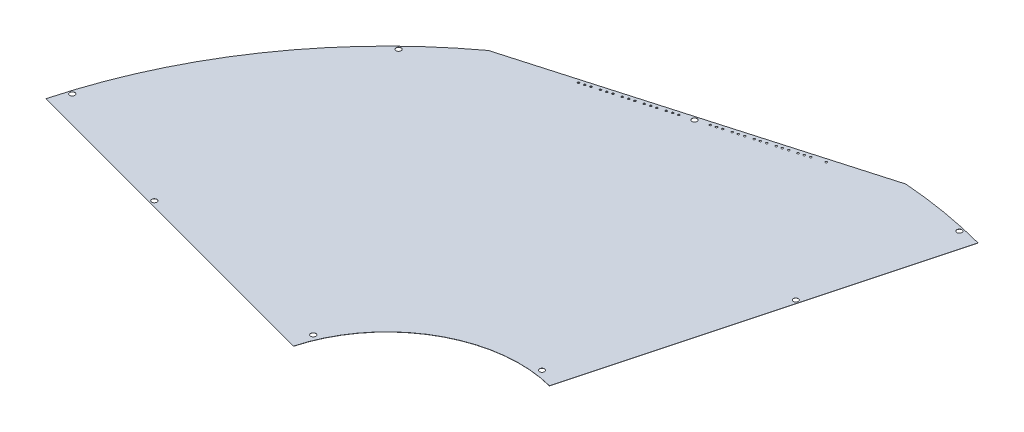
ISO-10303-21;
HEADER;
FILE_DESCRIPTION(('STEP AP214'),'2;1');
FILE_NAME('part.step','',(''),(''),'','','');
FILE_SCHEMA(('AUTOMOTIVE_DESIGN { 1 0 10303 214 1 1 1 1 }'));
ENDSEC;
DATA;
#1=APPLICATION_CONTEXT('core data for automotive mechanical design processes');
#2=APPLICATION_PROTOCOL_DEFINITION('international standard','automotive_design',2000,#1);
#3=PRODUCT_CONTEXT('',#1,'mechanical');
#4=PRODUCT('Part','Part','',(#3));
#5=PRODUCT_RELATED_PRODUCT_CATEGORY('part','',(#4));
#6=PRODUCT_DEFINITION_FORMATION('','',#4);
#7=PRODUCT_DEFINITION_CONTEXT('part definition',#1,'design');
#8=PRODUCT_DEFINITION('design','',#6,#7);
#9=PRODUCT_DEFINITION_SHAPE('','',#8);
#10=(LENGTH_UNIT() NAMED_UNIT(*) SI_UNIT(.MILLI.,.METRE.));
#11=(NAMED_UNIT(*) PLANE_ANGLE_UNIT() SI_UNIT($,.RADIAN.));
#12=(NAMED_UNIT(*) SI_UNIT($,.STERADIAN.) SOLID_ANGLE_UNIT());
#13=UNCERTAINTY_MEASURE_WITH_UNIT(LENGTH_MEASURE(1.E-05),#10,'distance_accuracy_value','');
#14=(GEOMETRIC_REPRESENTATION_CONTEXT(3) GLOBAL_UNCERTAINTY_ASSIGNED_CONTEXT((#13)) GLOBAL_UNIT_ASSIGNED_CONTEXT((#10,
#11,#12)) REPRESENTATION_CONTEXT('',''));
#15=CARTESIAN_POINT('',(0.,0.,0.));
#16=DIRECTION('',(0.,0.,1.));
#17=DIRECTION('',(1.,0.,0.));
#18=AXIS2_PLACEMENT_3D('',#15,#16,#17);
#19=CARTESIAN_POINT('',(0.,0.13,0.));
#20=DIRECTION('',(0.,-1.,0.));
#21=DIRECTION('',(0.,0.,-1.));
#22=AXIS2_PLACEMENT_3D('',#19,#20,#21);
#23=PLANE('',#22);
#24=CARTESIAN_POINT('',(-16.8296415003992,0.13,-363.440178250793));
#25=DIRECTION('',(0.,-1.,0.));
#26=DIRECTION('',(0.,0.,-1.));
#27=AXIS2_PLACEMENT_3D('',#24,#25,#26);
#28=CIRCLE('',#27,0.74999999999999);
#29=CARTESIAN_POINT('',(-16.8296415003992,0.13,-364.190178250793));
#30=VERTEX_POINT('',#29);
#31=EDGE_CURVE('E317',#30,#30,#28,.T.);
#32=ORIENTED_EDGE('',*,*,#31,.T.);
#33=EDGE_LOOP('',(#32));
#34=FACE_BOUND('',#33,.T.);
#35=CARTESIAN_POINT('',(-87.9630069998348,0.13,-343.043013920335));
#36=DIRECTION('',(0.,-1.,0.));
#37=DIRECTION('',(0.,0.,1.));
#38=AXIS2_PLACEMENT_3D('',#35,#36,#37);
#39=CIRCLE('',#38,0.749999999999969);
#40=CARTESIAN_POINT('',(-87.9630069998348,0.13,-342.293013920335));
#41=VERTEX_POINT('',#40);
#42=EDGE_CURVE('E325',#41,#41,#39,.T.);
#43=ORIENTED_EDGE('',*,*,#42,.T.);
#44=EDGE_LOOP('',(#43));
#45=FACE_BOUND('',#44,.T.);
#46=CARTESIAN_POINT('',(-74.5053432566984,0.13,-346.901936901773));
#47=DIRECTION('',(0.,-1.,0.));
#48=DIRECTION('',(0.,0.,1.));
#49=AXIS2_PLACEMENT_3D('',#46,#47,#48);
#50=CIRCLE('',#49,0.750000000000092);
#51=CARTESIAN_POINT('',(-74.5053432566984,0.13,-346.151936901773));
#52=VERTEX_POINT('',#51);
#53=EDGE_CURVE('E331',#52,#52,#50,.T.);
#54=ORIENTED_EDGE('',*,*,#53,.T.);
#55=EDGE_LOOP('',(#54));
#56=FACE_BOUND('',#55,.T.);
#57=CARTESIAN_POINT('',(-70.6602964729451,0.13,-348.004486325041));
#58=DIRECTION('',(0.,-1.,0.));
#59=DIRECTION('',(0.,0.,1.));
#60=AXIS2_PLACEMENT_3D('',#57,#58,#59);
#61=CIRCLE('',#60,0.750000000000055);
#62=CARTESIAN_POINT('',(-70.6602964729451,0.13,-347.254486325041));
#63=VERTEX_POINT('',#62);
#64=EDGE_CURVE('E337',#63,#63,#61,.T.);
#65=ORIENTED_EDGE('',*,*,#64,.T.);
#66=EDGE_LOOP('',(#65));
#67=FACE_BOUND('',#66,.T.);
#68=CARTESIAN_POINT('',(-84.1179602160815,0.13,-344.145563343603));
#69=DIRECTION('',(0.,-1.,0.));
#70=DIRECTION('',(0.,0.,1.));
#71=AXIS2_PLACEMENT_3D('',#68,#69,#70);
#72=CIRCLE('',#71,0.750000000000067);
#73=CARTESIAN_POINT('',(-84.1179602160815,0.13,-343.395563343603));
#74=VERTEX_POINT('',#73);
#75=EDGE_CURVE('E343',#74,#74,#72,.T.);
#76=ORIENTED_EDGE('',*,*,#75,.T.);
#77=EDGE_LOOP('',(#76));
#78=FACE_BOUND('',#77,.T.);
#79=CARTESIAN_POINT('',(-80.2729134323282,0.13,-345.248112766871));
#80=DIRECTION('',(0.,-1.,0.));
#81=DIRECTION('',(0.,0.,1.));
#82=AXIS2_PLACEMENT_3D('',#79,#80,#81);
#83=CIRCLE('',#82,0.749999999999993);
#84=CARTESIAN_POINT('',(-80.2729134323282,0.13,-344.498112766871));
#85=VERTEX_POINT('',#84);
#86=EDGE_CURVE('E349',#85,#85,#83,.T.);
#87=ORIENTED_EDGE('',*,*,#86,.T.);
#88=EDGE_LOOP('',(#87));
#89=FACE_BOUND('',#88,.T.);
#90=CARTESIAN_POINT('',(-66.8152496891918,0.13,-349.107035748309));
#91=DIRECTION('',(0.,-1.,0.));
#92=DIRECTION('',(0.,0.,1.));
#93=AXIS2_PLACEMENT_3D('',#90,#91,#92);
#94=CIRCLE('',#93,0.750000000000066);
#95=CARTESIAN_POINT('',(-66.8152496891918,0.13,-348.357035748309));
#96=VERTEX_POINT('',#95);
#97=EDGE_CURVE('E355',#96,#96,#94,.T.);
#98=ORIENTED_EDGE('',*,*,#97,.T.);
#99=EDGE_LOOP('',(#98));
#100=FACE_BOUND('',#99,.T.);
#101=CARTESIAN_POINT('',(-61.0476795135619,0.13,-350.760859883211));
#102=DIRECTION('',(0.,-1.,0.));
#103=DIRECTION('',(0.,0.,1.));
#104=AXIS2_PLACEMENT_3D('',#101,#102,#103);
#105=CIRCLE('',#104,0.750000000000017);
#106=CARTESIAN_POINT('',(-61.0476795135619,0.13,-350.010859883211));
#107=VERTEX_POINT('',#106);
#108=EDGE_CURVE('E361',#107,#107,#105,.T.);
#109=ORIENTED_EDGE('',*,*,#108,.T.);
#110=EDGE_LOOP('',(#109));
#111=FACE_BOUND('',#110,.T.);
#112=CARTESIAN_POINT('',(-57.2026327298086,0.13,-351.863409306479));
#113=DIRECTION('',(0.,-1.,0.));
#114=DIRECTION('',(0.,0.,1.));
#115=AXIS2_PLACEMENT_3D('',#112,#113,#114);
#116=CIRCLE('',#115,0.750000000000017);
#117=CARTESIAN_POINT('',(-57.2026327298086,0.13,-351.113409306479));
#118=VERTEX_POINT('',#117);
#119=EDGE_CURVE('E367',#118,#118,#116,.T.);
#120=ORIENTED_EDGE('',*,*,#119,.T.);
#121=EDGE_LOOP('',(#120));
#122=FACE_BOUND('',#121,.T.);
#123=CARTESIAN_POINT('',(-53.3575859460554,0.13,-352.965958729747));
#124=DIRECTION('',(0.,-1.,0.));
#125=DIRECTION('',(0.,0.,1.));
#126=AXIS2_PLACEMENT_3D('',#123,#124,#125);
#127=CIRCLE('',#126,0.749999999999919);
#128=CARTESIAN_POINT('',(-53.3575859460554,0.13,-352.215958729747));
#129=VERTEX_POINT('',#128);
#130=EDGE_CURVE('E373',#129,#129,#127,.T.);
#131=ORIENTED_EDGE('',*,*,#130,.T.);
#132=EDGE_LOOP('',(#131));
#133=FACE_BOUND('',#132,.T.);
#134=CARTESIAN_POINT('',(-47.5900157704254,0.13,-354.619782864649));
#135=DIRECTION('',(0.,-1.,0.));
#136=DIRECTION('',(0.,0.,1.));
#137=AXIS2_PLACEMENT_3D('',#134,#135,#136);
#138=CIRCLE('',#137,0.749999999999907);
#139=CARTESIAN_POINT('',(-47.5900157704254,0.13,-353.869782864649));
#140=VERTEX_POINT('',#139);
#141=EDGE_CURVE('E379',#140,#140,#138,.T.);
#142=ORIENTED_EDGE('',*,*,#141,.T.);
#143=EDGE_LOOP('',(#142));
#144=FACE_BOUND('',#143,.T.);
#145=CARTESIAN_POINT('',(-43.7449689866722,0.13,-355.722332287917));
#146=DIRECTION('',(0.,-1.,0.));
#147=DIRECTION('',(0.,0.,1.));
#148=AXIS2_PLACEMENT_3D('',#145,#146,#147);
#149=CIRCLE('',#148,0.749999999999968);
#150=CARTESIAN_POINT('',(-43.7449689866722,0.13,-354.972332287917));
#151=VERTEX_POINT('',#150);
#152=EDGE_CURVE('E385',#151,#151,#149,.T.);
#153=ORIENTED_EDGE('',*,*,#152,.T.);
#154=EDGE_LOOP('',(#153));
#155=FACE_BOUND('',#154,.T.);
#156=CARTESIAN_POINT('',(-39.8999222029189,0.13,-356.824881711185));
#157=DIRECTION('',(0.,-1.,0.));
#158=DIRECTION('',(0.,0.,1.));
#159=AXIS2_PLACEMENT_3D('',#156,#157,#158);
#160=CIRCLE('',#159,0.749999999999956);
#161=CARTESIAN_POINT('',(-39.8999222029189,0.13,-356.074881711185));
#162=VERTEX_POINT('',#161);
#163=EDGE_CURVE('E391',#162,#162,#160,.T.);
#164=ORIENTED_EDGE('',*,*,#163,.T.);
#165=EDGE_LOOP('',(#164));
#166=FACE_BOUND('',#165,.T.);
#167=CARTESIAN_POINT('',(-34.132352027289,0.13,-358.478705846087));
#168=DIRECTION('',(0.,-1.,0.));
#169=DIRECTION('',(0.,0.,1.));
#170=AXIS2_PLACEMENT_3D('',#167,#168,#169);
#171=CIRCLE('',#170,0.749999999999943);
#172=CARTESIAN_POINT('',(-34.132352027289,0.13,-357.728705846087));
#173=VERTEX_POINT('',#172);
#174=EDGE_CURVE('E397',#173,#173,#171,.T.);
#175=ORIENTED_EDGE('',*,*,#174,.T.);
#176=EDGE_LOOP('',(#175));
#177=FACE_BOUND('',#176,.T.);
#178=CARTESIAN_POINT('',(-30.2873052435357,0.13,-359.581255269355));
#179=DIRECTION('',(0.,-1.,0.));
#180=DIRECTION('',(0.,0.,1.));
#181=AXIS2_PLACEMENT_3D('',#178,#179,#180);
#182=CIRCLE('',#181,0.750000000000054);
#183=CARTESIAN_POINT('',(-30.2873052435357,0.13,-358.831255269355));
#184=VERTEX_POINT('',#183);
#185=EDGE_CURVE('E403',#184,#184,#182,.T.);
#186=ORIENTED_EDGE('',*,*,#185,.T.);
#187=EDGE_LOOP('',(#186));
#188=FACE_BOUND('',#187,.T.);
#189=CARTESIAN_POINT('',(-168.708989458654,0.13,-319.889476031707));
#190=DIRECTION('',(0.,-1.,0.));
#191=DIRECTION('',(0.,0.,-1.));
#192=AXIS2_PLACEMENT_3D('',#189,#190,#191);
#193=CIRCLE('',#192,0.750000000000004);
#194=CARTESIAN_POINT('',(-168.708989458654,0.13,-320.639476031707));
#195=VERTEX_POINT('',#194);
#196=EDGE_CURVE('E409',#195,#195,#193,.T.);
#197=ORIENTED_EDGE('',*,*,#196,.T.);
#198=EDGE_LOOP('',(#197));
#199=FACE_BOUND('',#198,.T.);
#200=CARTESIAN_POINT('',(-164.8639426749,0.13,-320.992025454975));
#201=DIRECTION('',(0.,-1.,0.));
#202=DIRECTION('',(0.,0.,-1.));
#203=AXIS2_PLACEMENT_3D('',#200,#201,#202);
#204=CIRCLE('',#203,0.750000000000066);
#205=CARTESIAN_POINT('',(-164.8639426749,0.13,-321.742025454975));
#206=VERTEX_POINT('',#205);
#207=EDGE_CURVE('E415',#206,#206,#204,.T.);
#208=ORIENTED_EDGE('',*,*,#207,.T.);
#209=EDGE_LOOP('',(#208));
#210=FACE_BOUND('',#209,.T.);
#211=CARTESIAN_POINT('',(-161.018895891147,0.13,-322.094574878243));
#212=DIRECTION('',(0.,-1.,0.));
#213=DIRECTION('',(0.,0.,-1.));
#214=AXIS2_PLACEMENT_3D('',#211,#212,#213);
#215=CIRCLE('',#214,0.749999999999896);
#216=CARTESIAN_POINT('',(-161.018895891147,0.13,-322.844574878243));
#217=VERTEX_POINT('',#216);
#218=EDGE_CURVE('E421',#217,#217,#215,.T.);
#219=ORIENTED_EDGE('',*,*,#218,.T.);
#220=EDGE_LOOP('',(#219));
#221=FACE_BOUND('',#220,.T.);
#222=CARTESIAN_POINT('',(-155.251325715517,0.13,-323.748399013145));
#223=DIRECTION('',(0.,-1.,0.));
#224=DIRECTION('',(0.,0.,-1.));
#225=AXIS2_PLACEMENT_3D('',#222,#223,#224);
#226=CIRCLE('',#225,0.749999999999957);
#227=CARTESIAN_POINT('',(-155.251325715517,0.13,-324.498399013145));
#228=VERTEX_POINT('',#227);
#229=EDGE_CURVE('E427',#228,#228,#226,.T.);
#230=ORIENTED_EDGE('',*,*,#229,.T.);
#231=EDGE_LOOP('',(#230));
#232=FACE_BOUND('',#231,.T.);
#233=CARTESIAN_POINT('',(-151.406278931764,0.13,-324.850948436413));
#234=DIRECTION('',(0.,-1.,0.));
#235=DIRECTION('',(0.,0.,-1.));
#236=AXIS2_PLACEMENT_3D('',#233,#234,#235);
#237=CIRCLE('',#236,0.749999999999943);
#238=CARTESIAN_POINT('',(-151.406278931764,0.13,-325.600948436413));
#239=VERTEX_POINT('',#238);
#240=EDGE_CURVE('E433',#239,#239,#237,.T.);
#241=ORIENTED_EDGE('',*,*,#240,.T.);
#242=EDGE_LOOP('',(#241));
#243=FACE_BOUND('',#242,.T.);
#244=CARTESIAN_POINT('',(-147.561232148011,0.13,-325.953497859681));
#245=DIRECTION('',(0.,-1.,0.));
#246=DIRECTION('',(0.,0.,-1.));
#247=AXIS2_PLACEMENT_3D('',#244,#245,#246);
#248=CIRCLE('',#247,0.750000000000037);
#249=CARTESIAN_POINT('',(-147.561232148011,0.13,-326.703497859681));
#250=VERTEX_POINT('',#249);
#251=EDGE_CURVE('E439',#250,#250,#248,.T.);
#252=ORIENTED_EDGE('',*,*,#251,.T.);
#253=EDGE_LOOP('',(#252));
#254=FACE_BOUND('',#253,.T.);
#255=CARTESIAN_POINT('',(-141.793661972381,0.13,-327.607321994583));
#256=DIRECTION('',(0.,-1.,0.));
#257=DIRECTION('',(0.,0.,-1.));
#258=AXIS2_PLACEMENT_3D('',#255,#256,#257);
#259=CIRCLE('',#258,0.750000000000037);
#260=CARTESIAN_POINT('',(-141.793661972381,0.13,-328.357321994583));
#261=VERTEX_POINT('',#260);
#262=EDGE_CURVE('E445',#261,#261,#259,.T.);
#263=ORIENTED_EDGE('',*,*,#262,.T.);
#264=EDGE_LOOP('',(#263));
#265=FACE_BOUND('',#264,.T.);
#266=CARTESIAN_POINT('',(-137.948615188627,0.13,-328.709871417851));
#267=DIRECTION('',(0.,-1.,0.));
#268=DIRECTION('',(0.,0.,-1.));
#269=AXIS2_PLACEMENT_3D('',#266,#267,#268);
#270=CIRCLE('',#269,0.74999999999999);
#271=CARTESIAN_POINT('',(-137.948615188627,0.13,-329.459871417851));
#272=VERTEX_POINT('',#271);
#273=EDGE_CURVE('E451',#272,#272,#270,.T.);
#274=ORIENTED_EDGE('',*,*,#273,.T.);
#275=EDGE_LOOP('',(#274));
#276=FACE_BOUND('',#275,.T.);
#277=CARTESIAN_POINT('',(-134.103568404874,0.13,-329.812420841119));
#278=DIRECTION('',(0.,-1.,0.));
#279=DIRECTION('',(0.,0.,-1.));
#280=AXIS2_PLACEMENT_3D('',#277,#278,#279);
#281=CIRCLE('',#280,0.749999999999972);
#282=CARTESIAN_POINT('',(-134.103568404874,0.13,-330.562420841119));
#283=VERTEX_POINT('',#282);
#284=EDGE_CURVE('E457',#283,#283,#281,.T.);
#285=ORIENTED_EDGE('',*,*,#284,.T.);
#286=EDGE_LOOP('',(#285));
#287=FACE_BOUND('',#286,.T.);
#288=CARTESIAN_POINT('',(-128.335998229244,0.13,-331.466244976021));
#289=DIRECTION('',(0.,-1.,0.));
#290=DIRECTION('',(0.,0.,-1.));
#291=AXIS2_PLACEMENT_3D('',#288,#289,#290);
#292=CIRCLE('',#291,0.749999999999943);
#293=CARTESIAN_POINT('',(-128.335998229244,0.13,-332.216244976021));
#294=VERTEX_POINT('',#293);
#295=EDGE_CURVE('E463',#294,#294,#292,.T.);
#296=ORIENTED_EDGE('',*,*,#295,.T.);
#297=EDGE_LOOP('',(#296));
#298=FACE_BOUND('',#297,.T.);
#299=CARTESIAN_POINT('',(-114.878334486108,0.13,-335.325167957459));
#300=DIRECTION('',(0.,-1.,0.));
#301=DIRECTION('',(0.,0.,-1.));
#302=AXIS2_PLACEMENT_3D('',#299,#300,#301);
#303=CIRCLE('',#302,0.74999999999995);
#304=CARTESIAN_POINT('',(-114.878334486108,0.13,-336.075167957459));
#305=VERTEX_POINT('',#304);
#306=EDGE_CURVE('E469',#305,#305,#303,.T.);
#307=ORIENTED_EDGE('',*,*,#306,.T.);
#308=EDGE_LOOP('',(#307));
#309=FACE_BOUND('',#308,.T.);
#310=CARTESIAN_POINT('',(-111.033287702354,0.13,-336.427717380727));
#311=DIRECTION('',(0.,-1.,0.));
#312=DIRECTION('',(0.,0.,-1.));
#313=AXIS2_PLACEMENT_3D('',#310,#311,#312);
#314=CIRCLE('',#313,0.750000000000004);
#315=CARTESIAN_POINT('',(-111.033287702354,0.13,-337.177717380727));
#316=VERTEX_POINT('',#315);
#317=EDGE_CURVE('E475',#316,#316,#314,.T.);
#318=ORIENTED_EDGE('',*,*,#317,.T.);
#319=EDGE_LOOP('',(#318));
#320=FACE_BOUND('',#319,.T.);
#321=CARTESIAN_POINT('',(-124.490951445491,0.13,-332.568794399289));
#322=DIRECTION('',(0.,-1.,0.));
#323=DIRECTION('',(0.,0.,-1.));
#324=AXIS2_PLACEMENT_3D('',#321,#322,#323);
#325=CIRCLE('',#324,0.749999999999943);
#326=CARTESIAN_POINT('',(-124.490951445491,0.13,-333.318794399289));
#327=VERTEX_POINT('',#326);
#328=EDGE_CURVE('E481',#327,#327,#325,.T.);
#329=ORIENTED_EDGE('',*,*,#328,.T.);
#330=EDGE_LOOP('',(#329));
#331=FACE_BOUND('',#330,.T.);
#332=CARTESIAN_POINT('',(-120.645904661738,0.13,-333.671343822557));
#333=DIRECTION('',(0.,-1.,0.));
#334=DIRECTION('',(0.,0.,-1.));
#335=AXIS2_PLACEMENT_3D('',#332,#333,#334);
#336=CIRCLE('',#335,0.749999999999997);
#337=CARTESIAN_POINT('',(-120.645904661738,0.13,-334.421343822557));
#338=VERTEX_POINT('',#337);
#339=EDGE_CURVE('E487',#338,#338,#336,.T.);
#340=ORIENTED_EDGE('',*,*,#339,.T.);
#341=EDGE_LOOP('',(#340));
#342=FACE_BOUND('',#341,.T.);
#343=CARTESIAN_POINT('',(-26.4422584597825,0.13,-360.683804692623));
#344=DIRECTION('',(0.,-1.,0.));
#345=DIRECTION('',(0.,0.,1.));
#346=AXIS2_PLACEMENT_3D('',#343,#344,#345);
#347=CIRCLE('',#346,0.750000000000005);
#348=CARTESIAN_POINT('',(-26.4422584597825,0.13,-359.933804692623));
#349=VERTEX_POINT('',#348);
#350=EDGE_CURVE('E493',#349,#349,#347,.T.);
#351=ORIENTED_EDGE('',*,*,#350,.T.);
#352=EDGE_LOOP('',(#351));
#353=FACE_BOUND('',#352,.T.);
#354=CARTESIAN_POINT('',(-107.188240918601,0.13,-337.530266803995));
#355=DIRECTION('',(0.,-1.,0.));
#356=DIRECTION('',(0.,0.,-1.));
#357=AXIS2_PLACEMENT_3D('',#354,#355,#356);
#358=CIRCLE('',#357,0.750000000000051);
#359=CARTESIAN_POINT('',(-107.188240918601,0.13,-338.280266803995));
#360=VERTEX_POINT('',#359);
#361=EDGE_CURVE('E499',#360,#360,#358,.T.);
#362=ORIENTED_EDGE('',*,*,#361,.T.);
#363=EDGE_LOOP('',(#362));
#364=FACE_BOUND('',#363,.T.);
#365=CARTESIAN_POINT('',(65.3116260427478,0.13,-257.26926828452));
#366=DIRECTION('',(0.,1.,0.));
#367=DIRECTION('',(0.,0.,1.));
#368=AXIS2_PLACEMENT_3D('',#365,#366,#367);
#369=CIRCLE('',#368,2.);
#370=CARTESIAN_POINT('',(65.3116260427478,0.13,-255.26926828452));
#371=VERTEX_POINT('',#370);
#372=EDGE_CURVE('E511',#371,#371,#369,.T.);
#373=ORIENTED_EDGE('',*,*,#372,.F.);
#374=EDGE_LOOP('',(#373));
#375=FACE_BOUND('',#374,.T.);
#376=CARTESIAN_POINT('',(13.2141853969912,0.13,-109.203412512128));
#377=DIRECTION('',(0.,1.,0.));
#378=DIRECTION('',(0.,0.,1.));
#379=AXIS2_PLACEMENT_3D('',#376,#377,#378);
#380=CIRCLE('',#379,2.);
#381=CARTESIAN_POINT('',(13.2141853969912,0.13,-107.203412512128));
#382=VERTEX_POINT('',#381);
#383=EDGE_CURVE('E523',#382,#382,#380,.T.);
#384=ORIENTED_EDGE('',*,*,#383,.F.);
#385=EDGE_LOOP('',(#384));
#386=FACE_BOUND('',#385,.T.);
#387=CARTESIAN_POINT('',(-101.18002211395,0.13,-43.1578860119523));
#388=DIRECTION('',(0.,1.,0.));
#389=DIRECTION('',(0.,0.,1.));
#390=AXIS2_PLACEMENT_3D('',#387,#388,#389);
#391=CIRCLE('',#390,2.);
#392=CARTESIAN_POINT('',(-101.18002211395,0.13,-41.1578860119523));
#393=VERTEX_POINT('',#392);
#394=EDGE_CURVE('E535',#393,#393,#391,.T.);
#395=ORIENTED_EDGE('',*,*,#394,.F.);
#396=EDGE_LOOP('',(#395));
#397=FACE_BOUND('',#396,.T.);
#398=CARTESIAN_POINT('',(-360.801175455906,0.13,-112.723164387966));
#399=DIRECTION('',(0.,1.,0.));
#400=DIRECTION('',(0.,0.,1.));
#401=AXIS2_PLACEMENT_3D('',#398,#399,#400);
#402=CIRCLE('',#401,2.);
#403=CARTESIAN_POINT('',(-360.801175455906,0.13,-110.723164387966));
#404=VERTEX_POINT('',#403);
#405=EDGE_CURVE('E119',#404,#404,#402,.T.);
#406=ORIENTED_EDGE('',*,*,#405,.F.);
#407=EDGE_LOOP('',(#406));
#408=FACE_BOUND('',#407,.T.);
#409=CARTESIAN_POINT('',(0.,0.13,0.));
#410=DIRECTION('',(0.,1.,0.));
#411=DIRECTION('',(0.,0.,-1.));
#412=AXIS2_PLACEMENT_3D('',#409,#410,#411);
#413=CIRCLE('',#412,381.);
#414=CARTESIAN_POINT('',(98.1270083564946,0.13,-368.146832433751));
#415=VERTEX_POINT('',#414);
#416=CARTESIAN_POINT('',(29.5283591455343,0.13,-379.854019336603));
#417=VERTEX_POINT('',#416);
#418=EDGE_CURVE('E126',#415,#417,#413,.T.);
#419=ORIENTED_EDGE('',*,*,#418,.T.);
#420=DIRECTION('',(-0.961261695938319,0.,0.275637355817));
#421=VECTOR('',#420,1.);
#422=CARTESIAN_POINT('',(29.5283591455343,0.13,-379.854019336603));
#423=LINE('',#422,#421);
#424=CARTESIAN_POINT('',(-226.333431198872,0.13,-306.486831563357));
#425=VERTEX_POINT('',#424);
#426=EDGE_CURVE('E84',#417,#425,#423,.T.);
#427=ORIENTED_EDGE('',*,*,#426,.T.);
#428=CARTESIAN_POINT('',(0.,0.13,0.));
#429=DIRECTION('',(0.,1.,0.));
#430=DIRECTION('',(0.,0.,-1.));
#431=AXIS2_PLACEMENT_3D('',#428,#429,#430);
#432=CIRCLE('',#431,381.);
#433=CARTESIAN_POINT('',(-367.888013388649,0.13,-99.0929341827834));
#434=VERTEX_POINT('',#433);
#435=EDGE_CURVE('E97',#425,#434,#432,.T.);
#436=ORIENTED_EDGE('',*,*,#435,.T.);
#437=DIRECTION('',(0.965925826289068,0.,0.258819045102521));
#438=VECTOR('',#437,1.);
#439=CARTESIAN_POINT('',(-101.291652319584,0.13,-27.6586545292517));
#440=LINE('',#439,#438);
#441=CARTESIAN_POINT('',(-101.291652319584,0.13,-27.6586545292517));
#442=VERTEX_POINT('',#441);
#443=EDGE_CURVE('E91',#434,#442,#440,.T.);
#444=ORIENTED_EDGE('',*,*,#443,.T.);
#445=CARTESIAN_POINT('',(0.,0.13,0.));
#446=DIRECTION('',(0.,-1.,0.));
#447=DIRECTION('',(0.,0.,-1.));
#448=AXIS2_PLACEMENT_3D('',#445,#446,#447);
#449=CIRCLE('',#448,105.);
#450=CARTESIAN_POINT('',(26.6927287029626,0.13,-101.550471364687));
#451=VERTEX_POINT('',#450);
#452=EDGE_CURVE('E95',#442,#451,#449,.T.);
#453=ORIENTED_EDGE('',*,*,#452,.T.);
#454=DIRECTION('',(0.258819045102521,0.,-0.965925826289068));
#455=VECTOR('',#454,1.);
#456=CARTESIAN_POINT('',(26.6927287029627,0.13,-101.550471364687));
#457=LINE('',#456,#455);
#458=EDGE_CURVE('E47',#451,#415,#457,.T.);
#459=ORIENTED_EDGE('',*,*,#458,.T.);
#460=EDGE_LOOP('',(#419,#427,#436,#444,#453,#459));
#461=FACE_BOUND('',#460,.T.);
#462=CARTESIAN_POINT('',(-262.5808640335,0.13,-271.910444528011));
#463=DIRECTION('',(0.,1.,0.));
#464=DIRECTION('',(0.,0.,1.));
#465=AXIS2_PLACEMENT_3D('',#462,#463,#464);
#466=CIRCLE('',#465,2.);
#467=CARTESIAN_POINT('',(-262.5808640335,0.13,-269.910444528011));
#468=VERTEX_POINT('',#467);
#469=EDGE_CURVE('E541',#468,#468,#466,.T.);
#470=ORIENTED_EDGE('',*,*,#469,.F.);
#471=EDGE_LOOP('',(#470));
#472=FACE_BOUND('',#471,.T.);
#473=CARTESIAN_POINT('',(-97.5756239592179,0.13,-340.286640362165));
#474=DIRECTION('',(0.,1.,0.));
#475=DIRECTION('',(0.,0.,1.));
#476=AXIS2_PLACEMENT_3D('',#473,#474,#475);
#477=CIRCLE('',#476,2.);
#478=CARTESIAN_POINT('',(-97.5756239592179,0.13,-338.286640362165));
#479=VERTEX_POINT('',#478);
#480=EDGE_CURVE('E529',#479,#479,#477,.T.);
#481=ORIENTED_EDGE('',*,*,#480,.F.);
#482=EDGE_LOOP('',(#481));
#483=FACE_BOUND('',#482,.T.);
#484=CARTESIAN_POINT('',(82.7794637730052,0.13,-368.824565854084));
#485=DIRECTION('',(0.,1.,0.));
#486=DIRECTION('',(0.,0.,1.));
#487=AXIS2_PLACEMENT_3D('',#484,#485,#486);
#488=CIRCLE('',#487,1.99999999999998);
#489=CARTESIAN_POINT('',(82.7794637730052,0.13,-366.824565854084));
#490=VERTEX_POINT('',#489);
#491=EDGE_CURVE('E517',#490,#490,#488,.T.);
#492=ORIENTED_EDGE('',*,*,#491,.F.);
#493=EDGE_LOOP('',(#492));
#494=FACE_BOUND('',#493,.T.);
#495=CARTESIAN_POINT('',(-255.457534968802,0.13,-72.0731068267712));
#496=DIRECTION('',(0.,1.,0.));
#497=DIRECTION('',(0.,0.,1.));
#498=AXIS2_PLACEMENT_3D('',#495,#496,#497);
#499=CIRCLE('',#498,2.);
#500=CARTESIAN_POINT('',(-255.457534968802,0.13,-70.0731068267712));
#501=VERTEX_POINT('',#500);
#502=EDGE_CURVE('E505',#501,#501,#499,.T.);
#503=ORIENTED_EDGE('',*,*,#502,.F.);
#504=EDGE_LOOP('',(#503));
#505=FACE_BOUND('',#504,.T.);
#506=ADVANCED_FACE('F30',(#34,#45,#56,#67,#78,#89,#100,#111,#122,#133,#144,#155,#166,#177,#188,
#199,#210,#221,#232,#243,#254,#265,#276,#287,#298,#309,#320,#331,#342,#353,#364,#375,#386,#397,
#408,#461,#472,#483,#494,#505),#23,.F.);
#507=CARTESIAN_POINT('',(0.,0.,0.));
#508=DIRECTION('',(0.,-1.,0.));
#509=DIRECTION('',(0.,0.,-1.));
#510=AXIS2_PLACEMENT_3D('',#507,#508,#509);
#511=PLANE('',#510);
#512=CARTESIAN_POINT('',(-16.8296415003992,0.,-363.440178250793));
#513=DIRECTION('',(0.,-1.,0.));
#514=DIRECTION('',(0.,0.,-1.));
#515=AXIS2_PLACEMENT_3D('',#512,#513,#514);
#516=CIRCLE('',#515,0.74999999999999);
#517=CARTESIAN_POINT('',(-16.8296415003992,0.,-364.190178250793));
#518=VERTEX_POINT('',#517);
#519=EDGE_CURVE('E320',#518,#518,#516,.T.);
#520=ORIENTED_EDGE('',*,*,#519,.F.);
#521=EDGE_LOOP('',(#520));
#522=FACE_BOUND('',#521,.T.);
#523=CARTESIAN_POINT('',(-87.9630069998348,0.,-343.043013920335));
#524=DIRECTION('',(0.,-1.,0.));
#525=DIRECTION('',(0.,0.,1.));
#526=AXIS2_PLACEMENT_3D('',#523,#524,#525);
#527=CIRCLE('',#526,0.749999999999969);
#528=CARTESIAN_POINT('',(-87.9630069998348,0.,-342.293013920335));
#529=VERTEX_POINT('',#528);
#530=EDGE_CURVE('E322',#529,#529,#527,.T.);
#531=ORIENTED_EDGE('',*,*,#530,.F.);
#532=EDGE_LOOP('',(#531));
#533=FACE_BOUND('',#532,.T.);
#534=CARTESIAN_POINT('',(-74.5053432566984,0.,-346.901936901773));
#535=DIRECTION('',(0.,-1.,0.));
#536=DIRECTION('',(0.,0.,1.));
#537=AXIS2_PLACEMENT_3D('',#534,#535,#536);
#538=CIRCLE('',#537,0.750000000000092);
#539=CARTESIAN_POINT('',(-74.5053432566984,0.,-346.151936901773));
#540=VERTEX_POINT('',#539);
#541=EDGE_CURVE('E328',#540,#540,#538,.T.);
#542=ORIENTED_EDGE('',*,*,#541,.F.);
#543=EDGE_LOOP('',(#542));
#544=FACE_BOUND('',#543,.T.);
#545=CARTESIAN_POINT('',(-70.6602964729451,0.,-348.004486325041));
#546=DIRECTION('',(0.,-1.,0.));
#547=DIRECTION('',(0.,0.,1.));
#548=AXIS2_PLACEMENT_3D('',#545,#546,#547);
#549=CIRCLE('',#548,0.750000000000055);
#550=CARTESIAN_POINT('',(-70.6602964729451,0.,-347.254486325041));
#551=VERTEX_POINT('',#550);
#552=EDGE_CURVE('E334',#551,#551,#549,.T.);
#553=ORIENTED_EDGE('',*,*,#552,.F.);
#554=EDGE_LOOP('',(#553));
#555=FACE_BOUND('',#554,.T.);
#556=CARTESIAN_POINT('',(-84.1179602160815,0.,-344.145563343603));
#557=DIRECTION('',(0.,-1.,0.));
#558=DIRECTION('',(0.,0.,1.));
#559=AXIS2_PLACEMENT_3D('',#556,#557,#558);
#560=CIRCLE('',#559,0.750000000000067);
#561=CARTESIAN_POINT('',(-84.1179602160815,0.,-343.395563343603));
#562=VERTEX_POINT('',#561);
#563=EDGE_CURVE('E340',#562,#562,#560,.T.);
#564=ORIENTED_EDGE('',*,*,#563,.F.);
#565=EDGE_LOOP('',(#564));
#566=FACE_BOUND('',#565,.T.);
#567=CARTESIAN_POINT('',(-80.2729134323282,0.,-345.248112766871));
#568=DIRECTION('',(0.,-1.,0.));
#569=DIRECTION('',(0.,0.,1.));
#570=AXIS2_PLACEMENT_3D('',#567,#568,#569);
#571=CIRCLE('',#570,0.749999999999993);
#572=CARTESIAN_POINT('',(-80.2729134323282,0.,-344.498112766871));
#573=VERTEX_POINT('',#572);
#574=EDGE_CURVE('E346',#573,#573,#571,.T.);
#575=ORIENTED_EDGE('',*,*,#574,.F.);
#576=EDGE_LOOP('',(#575));
#577=FACE_BOUND('',#576,.T.);
#578=CARTESIAN_POINT('',(-66.8152496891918,0.,-349.107035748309));
#579=DIRECTION('',(0.,-1.,0.));
#580=DIRECTION('',(0.,0.,1.));
#581=AXIS2_PLACEMENT_3D('',#578,#579,#580);
#582=CIRCLE('',#581,0.750000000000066);
#583=CARTESIAN_POINT('',(-66.8152496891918,0.,-348.357035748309));
#584=VERTEX_POINT('',#583);
#585=EDGE_CURVE('E352',#584,#584,#582,.T.);
#586=ORIENTED_EDGE('',*,*,#585,.F.);
#587=EDGE_LOOP('',(#586));
#588=FACE_BOUND('',#587,.T.);
#589=CARTESIAN_POINT('',(-61.0476795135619,0.,-350.760859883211));
#590=DIRECTION('',(0.,-1.,0.));
#591=DIRECTION('',(0.,0.,1.));
#592=AXIS2_PLACEMENT_3D('',#589,#590,#591);
#593=CIRCLE('',#592,0.750000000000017);
#594=CARTESIAN_POINT('',(-61.0476795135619,0.,-350.010859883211));
#595=VERTEX_POINT('',#594);
#596=EDGE_CURVE('E358',#595,#595,#593,.T.);
#597=ORIENTED_EDGE('',*,*,#596,.F.);
#598=EDGE_LOOP('',(#597));
#599=FACE_BOUND('',#598,.T.);
#600=CARTESIAN_POINT('',(-57.2026327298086,0.,-351.863409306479));
#601=DIRECTION('',(0.,-1.,0.));
#602=DIRECTION('',(0.,0.,1.));
#603=AXIS2_PLACEMENT_3D('',#600,#601,#602);
#604=CIRCLE('',#603,0.750000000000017);
#605=CARTESIAN_POINT('',(-57.2026327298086,0.,-351.113409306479));
#606=VERTEX_POINT('',#605);
#607=EDGE_CURVE('E364',#606,#606,#604,.T.);
#608=ORIENTED_EDGE('',*,*,#607,.F.);
#609=EDGE_LOOP('',(#608));
#610=FACE_BOUND('',#609,.T.);
#611=CARTESIAN_POINT('',(-53.3575859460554,0.,-352.965958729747));
#612=DIRECTION('',(0.,-1.,0.));
#613=DIRECTION('',(0.,0.,1.));
#614=AXIS2_PLACEMENT_3D('',#611,#612,#613);
#615=CIRCLE('',#614,0.749999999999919);
#616=CARTESIAN_POINT('',(-53.3575859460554,0.,-352.215958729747));
#617=VERTEX_POINT('',#616);
#618=EDGE_CURVE('E370',#617,#617,#615,.T.);
#619=ORIENTED_EDGE('',*,*,#618,.F.);
#620=EDGE_LOOP('',(#619));
#621=FACE_BOUND('',#620,.T.);
#622=CARTESIAN_POINT('',(-47.5900157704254,0.,-354.619782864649));
#623=DIRECTION('',(0.,-1.,0.));
#624=DIRECTION('',(0.,0.,1.));
#625=AXIS2_PLACEMENT_3D('',#622,#623,#624);
#626=CIRCLE('',#625,0.749999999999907);
#627=CARTESIAN_POINT('',(-47.5900157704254,0.,-353.869782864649));
#628=VERTEX_POINT('',#627);
#629=EDGE_CURVE('E376',#628,#628,#626,.T.);
#630=ORIENTED_EDGE('',*,*,#629,.F.);
#631=EDGE_LOOP('',(#630));
#632=FACE_BOUND('',#631,.T.);
#633=CARTESIAN_POINT('',(-43.7449689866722,0.,-355.722332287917));
#634=DIRECTION('',(0.,-1.,0.));
#635=DIRECTION('',(0.,0.,1.));
#636=AXIS2_PLACEMENT_3D('',#633,#634,#635);
#637=CIRCLE('',#636,0.749999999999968);
#638=CARTESIAN_POINT('',(-43.7449689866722,0.,-354.972332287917));
#639=VERTEX_POINT('',#638);
#640=EDGE_CURVE('E382',#639,#639,#637,.T.);
#641=ORIENTED_EDGE('',*,*,#640,.F.);
#642=EDGE_LOOP('',(#641));
#643=FACE_BOUND('',#642,.T.);
#644=CARTESIAN_POINT('',(-39.8999222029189,0.,-356.824881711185));
#645=DIRECTION('',(0.,-1.,0.));
#646=DIRECTION('',(0.,0.,1.));
#647=AXIS2_PLACEMENT_3D('',#644,#645,#646);
#648=CIRCLE('',#647,0.749999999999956);
#649=CARTESIAN_POINT('',(-39.8999222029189,0.,-356.074881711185));
#650=VERTEX_POINT('',#649);
#651=EDGE_CURVE('E388',#650,#650,#648,.T.);
#652=ORIENTED_EDGE('',*,*,#651,.F.);
#653=EDGE_LOOP('',(#652));
#654=FACE_BOUND('',#653,.T.);
#655=CARTESIAN_POINT('',(-34.132352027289,0.,-358.478705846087));
#656=DIRECTION('',(0.,-1.,0.));
#657=DIRECTION('',(0.,0.,1.));
#658=AXIS2_PLACEMENT_3D('',#655,#656,#657);
#659=CIRCLE('',#658,0.749999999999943);
#660=CARTESIAN_POINT('',(-34.132352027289,0.,-357.728705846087));
#661=VERTEX_POINT('',#660);
#662=EDGE_CURVE('E394',#661,#661,#659,.T.);
#663=ORIENTED_EDGE('',*,*,#662,.F.);
#664=EDGE_LOOP('',(#663));
#665=FACE_BOUND('',#664,.T.);
#666=CARTESIAN_POINT('',(-30.2873052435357,0.,-359.581255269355));
#667=DIRECTION('',(0.,-1.,0.));
#668=DIRECTION('',(0.,0.,1.));
#669=AXIS2_PLACEMENT_3D('',#666,#667,#668);
#670=CIRCLE('',#669,0.750000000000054);
#671=CARTESIAN_POINT('',(-30.2873052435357,0.,-358.831255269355));
#672=VERTEX_POINT('',#671);
#673=EDGE_CURVE('E400',#672,#672,#670,.T.);
#674=ORIENTED_EDGE('',*,*,#673,.F.);
#675=EDGE_LOOP('',(#674));
#676=FACE_BOUND('',#675,.T.);
#677=CARTESIAN_POINT('',(-168.708989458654,0.,-319.889476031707));
#678=DIRECTION('',(0.,-1.,0.));
#679=DIRECTION('',(0.,0.,-1.));
#680=AXIS2_PLACEMENT_3D('',#677,#678,#679);
#681=CIRCLE('',#680,0.750000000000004);
#682=CARTESIAN_POINT('',(-168.708989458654,0.,-320.639476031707));
#683=VERTEX_POINT('',#682);
#684=EDGE_CURVE('E406',#683,#683,#681,.T.);
#685=ORIENTED_EDGE('',*,*,#684,.F.);
#686=EDGE_LOOP('',(#685));
#687=FACE_BOUND('',#686,.T.);
#688=CARTESIAN_POINT('',(-164.8639426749,0.,-320.992025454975));
#689=DIRECTION('',(0.,-1.,0.));
#690=DIRECTION('',(0.,0.,-1.));
#691=AXIS2_PLACEMENT_3D('',#688,#689,#690);
#692=CIRCLE('',#691,0.750000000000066);
#693=CARTESIAN_POINT('',(-164.8639426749,0.,-321.742025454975));
#694=VERTEX_POINT('',#693);
#695=EDGE_CURVE('E412',#694,#694,#692,.T.);
#696=ORIENTED_EDGE('',*,*,#695,.F.);
#697=EDGE_LOOP('',(#696));
#698=FACE_BOUND('',#697,.T.);
#699=CARTESIAN_POINT('',(-161.018895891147,0.,-322.094574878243));
#700=DIRECTION('',(0.,-1.,0.));
#701=DIRECTION('',(0.,0.,-1.));
#702=AXIS2_PLACEMENT_3D('',#699,#700,#701);
#703=CIRCLE('',#702,0.749999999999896);
#704=CARTESIAN_POINT('',(-161.018895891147,0.,-322.844574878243));
#705=VERTEX_POINT('',#704);
#706=EDGE_CURVE('E418',#705,#705,#703,.T.);
#707=ORIENTED_EDGE('',*,*,#706,.F.);
#708=EDGE_LOOP('',(#707));
#709=FACE_BOUND('',#708,.T.);
#710=CARTESIAN_POINT('',(-155.251325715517,0.,-323.748399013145));
#711=DIRECTION('',(0.,-1.,0.));
#712=DIRECTION('',(0.,0.,-1.));
#713=AXIS2_PLACEMENT_3D('',#710,#711,#712);
#714=CIRCLE('',#713,0.749999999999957);
#715=CARTESIAN_POINT('',(-155.251325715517,0.,-324.498399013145));
#716=VERTEX_POINT('',#715);
#717=EDGE_CURVE('E424',#716,#716,#714,.T.);
#718=ORIENTED_EDGE('',*,*,#717,.F.);
#719=EDGE_LOOP('',(#718));
#720=FACE_BOUND('',#719,.T.);
#721=CARTESIAN_POINT('',(-151.406278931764,0.,-324.850948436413));
#722=DIRECTION('',(0.,-1.,0.));
#723=DIRECTION('',(0.,0.,-1.));
#724=AXIS2_PLACEMENT_3D('',#721,#722,#723);
#725=CIRCLE('',#724,0.749999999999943);
#726=CARTESIAN_POINT('',(-151.406278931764,0.,-325.600948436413));
#727=VERTEX_POINT('',#726);
#728=EDGE_CURVE('E430',#727,#727,#725,.T.);
#729=ORIENTED_EDGE('',*,*,#728,.F.);
#730=EDGE_LOOP('',(#729));
#731=FACE_BOUND('',#730,.T.);
#732=CARTESIAN_POINT('',(-147.561232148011,0.,-325.953497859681));
#733=DIRECTION('',(0.,-1.,0.));
#734=DIRECTION('',(0.,0.,-1.));
#735=AXIS2_PLACEMENT_3D('',#732,#733,#734);
#736=CIRCLE('',#735,0.750000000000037);
#737=CARTESIAN_POINT('',(-147.561232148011,0.,-326.703497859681));
#738=VERTEX_POINT('',#737);
#739=EDGE_CURVE('E436',#738,#738,#736,.T.);
#740=ORIENTED_EDGE('',*,*,#739,.F.);
#741=EDGE_LOOP('',(#740));
#742=FACE_BOUND('',#741,.T.);
#743=CARTESIAN_POINT('',(-141.793661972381,0.,-327.607321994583));
#744=DIRECTION('',(0.,-1.,0.));
#745=DIRECTION('',(0.,0.,-1.));
#746=AXIS2_PLACEMENT_3D('',#743,#744,#745);
#747=CIRCLE('',#746,0.750000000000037);
#748=CARTESIAN_POINT('',(-141.793661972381,0.,-328.357321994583));
#749=VERTEX_POINT('',#748);
#750=EDGE_CURVE('E442',#749,#749,#747,.T.);
#751=ORIENTED_EDGE('',*,*,#750,.F.);
#752=EDGE_LOOP('',(#751));
#753=FACE_BOUND('',#752,.T.);
#754=CARTESIAN_POINT('',(-137.948615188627,0.,-328.709871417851));
#755=DIRECTION('',(0.,-1.,0.));
#756=DIRECTION('',(0.,0.,-1.));
#757=AXIS2_PLACEMENT_3D('',#754,#755,#756);
#758=CIRCLE('',#757,0.74999999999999);
#759=CARTESIAN_POINT('',(-137.948615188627,0.,-329.459871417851));
#760=VERTEX_POINT('',#759);
#761=EDGE_CURVE('E448',#760,#760,#758,.T.);
#762=ORIENTED_EDGE('',*,*,#761,.F.);
#763=EDGE_LOOP('',(#762));
#764=FACE_BOUND('',#763,.T.);
#765=CARTESIAN_POINT('',(-134.103568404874,0.,-329.812420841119));
#766=DIRECTION('',(0.,-1.,0.));
#767=DIRECTION('',(0.,0.,-1.));
#768=AXIS2_PLACEMENT_3D('',#765,#766,#767);
#769=CIRCLE('',#768,0.749999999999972);
#770=CARTESIAN_POINT('',(-134.103568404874,0.,-330.562420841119));
#771=VERTEX_POINT('',#770);
#772=EDGE_CURVE('E454',#771,#771,#769,.T.);
#773=ORIENTED_EDGE('',*,*,#772,.F.);
#774=EDGE_LOOP('',(#773));
#775=FACE_BOUND('',#774,.T.);
#776=CARTESIAN_POINT('',(-128.335998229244,0.,-331.466244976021));
#777=DIRECTION('',(0.,-1.,0.));
#778=DIRECTION('',(0.,0.,-1.));
#779=AXIS2_PLACEMENT_3D('',#776,#777,#778);
#780=CIRCLE('',#779,0.749999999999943);
#781=CARTESIAN_POINT('',(-128.335998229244,0.,-332.216244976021));
#782=VERTEX_POINT('',#781);
#783=EDGE_CURVE('E460',#782,#782,#780,.T.);
#784=ORIENTED_EDGE('',*,*,#783,.F.);
#785=EDGE_LOOP('',(#784));
#786=FACE_BOUND('',#785,.T.);
#787=CARTESIAN_POINT('',(-114.878334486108,0.,-335.325167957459));
#788=DIRECTION('',(0.,-1.,0.));
#789=DIRECTION('',(0.,0.,-1.));
#790=AXIS2_PLACEMENT_3D('',#787,#788,#789);
#791=CIRCLE('',#790,0.74999999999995);
#792=CARTESIAN_POINT('',(-114.878334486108,0.,-336.075167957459));
#793=VERTEX_POINT('',#792);
#794=EDGE_CURVE('E466',#793,#793,#791,.T.);
#795=ORIENTED_EDGE('',*,*,#794,.F.);
#796=EDGE_LOOP('',(#795));
#797=FACE_BOUND('',#796,.T.);
#798=CARTESIAN_POINT('',(-111.033287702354,0.,-336.427717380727));
#799=DIRECTION('',(0.,-1.,0.));
#800=DIRECTION('',(0.,0.,-1.));
#801=AXIS2_PLACEMENT_3D('',#798,#799,#800);
#802=CIRCLE('',#801,0.750000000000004);
#803=CARTESIAN_POINT('',(-111.033287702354,0.,-337.177717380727));
#804=VERTEX_POINT('',#803);
#805=EDGE_CURVE('E472',#804,#804,#802,.T.);
#806=ORIENTED_EDGE('',*,*,#805,.F.);
#807=EDGE_LOOP('',(#806));
#808=FACE_BOUND('',#807,.T.);
#809=CARTESIAN_POINT('',(-124.490951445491,0.,-332.568794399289));
#810=DIRECTION('',(0.,-1.,0.));
#811=DIRECTION('',(0.,0.,-1.));
#812=AXIS2_PLACEMENT_3D('',#809,#810,#811);
#813=CIRCLE('',#812,0.749999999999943);
#814=CARTESIAN_POINT('',(-124.490951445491,0.,-333.318794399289));
#815=VERTEX_POINT('',#814);
#816=EDGE_CURVE('E478',#815,#815,#813,.T.);
#817=ORIENTED_EDGE('',*,*,#816,.F.);
#818=EDGE_LOOP('',(#817));
#819=FACE_BOUND('',#818,.T.);
#820=CARTESIAN_POINT('',(-120.645904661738,0.,-333.671343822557));
#821=DIRECTION('',(0.,-1.,0.));
#822=DIRECTION('',(0.,0.,-1.));
#823=AXIS2_PLACEMENT_3D('',#820,#821,#822);
#824=CIRCLE('',#823,0.749999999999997);
#825=CARTESIAN_POINT('',(-120.645904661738,0.,-334.421343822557));
#826=VERTEX_POINT('',#825);
#827=EDGE_CURVE('E484',#826,#826,#824,.T.);
#828=ORIENTED_EDGE('',*,*,#827,.F.);
#829=EDGE_LOOP('',(#828));
#830=FACE_BOUND('',#829,.T.);
#831=CARTESIAN_POINT('',(-26.4422584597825,0.,-360.683804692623));
#832=DIRECTION('',(0.,-1.,0.));
#833=DIRECTION('',(0.,0.,1.));
#834=AXIS2_PLACEMENT_3D('',#831,#832,#833);
#835=CIRCLE('',#834,0.750000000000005);
#836=CARTESIAN_POINT('',(-26.4422584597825,0.,-359.933804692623));
#837=VERTEX_POINT('',#836);
#838=EDGE_CURVE('E490',#837,#837,#835,.T.);
#839=ORIENTED_EDGE('',*,*,#838,.F.);
#840=EDGE_LOOP('',(#839));
#841=FACE_BOUND('',#840,.T.);
#842=CARTESIAN_POINT('',(-107.188240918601,0.,-337.530266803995));
#843=DIRECTION('',(0.,-1.,0.));
#844=DIRECTION('',(0.,0.,-1.));
#845=AXIS2_PLACEMENT_3D('',#842,#843,#844);
#846=CIRCLE('',#845,0.750000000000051);
#847=CARTESIAN_POINT('',(-107.188240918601,0.,-338.280266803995));
#848=VERTEX_POINT('',#847);
#849=EDGE_CURVE('E496',#848,#848,#846,.T.);
#850=ORIENTED_EDGE('',*,*,#849,.F.);
#851=EDGE_LOOP('',(#850));
#852=FACE_BOUND('',#851,.T.);
#853=CARTESIAN_POINT('',(65.3116260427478,0.,-257.26926828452));
#854=DIRECTION('',(0.,1.,0.));
#855=DIRECTION('',(0.,0.,1.));
#856=AXIS2_PLACEMENT_3D('',#853,#854,#855);
#857=CIRCLE('',#856,2.);
#858=CARTESIAN_POINT('',(65.3116260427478,0.,-255.26926828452));
#859=VERTEX_POINT('',#858);
#860=EDGE_CURVE('E508',#859,#859,#857,.T.);
#861=ORIENTED_EDGE('',*,*,#860,.T.);
#862=EDGE_LOOP('',(#861));
#863=FACE_BOUND('',#862,.T.);
#864=CARTESIAN_POINT('',(13.2141853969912,0.,-109.203412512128));
#865=DIRECTION('',(0.,1.,0.));
#866=DIRECTION('',(0.,0.,1.));
#867=AXIS2_PLACEMENT_3D('',#864,#865,#866);
#868=CIRCLE('',#867,2.);
#869=CARTESIAN_POINT('',(13.2141853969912,0.,-107.203412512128));
#870=VERTEX_POINT('',#869);
#871=EDGE_CURVE('E520',#870,#870,#868,.T.);
#872=ORIENTED_EDGE('',*,*,#871,.T.);
#873=EDGE_LOOP('',(#872));
#874=FACE_BOUND('',#873,.T.);
#875=CARTESIAN_POINT('',(-101.18002211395,0.,-43.1578860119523));
#876=DIRECTION('',(0.,1.,0.));
#877=DIRECTION('',(0.,0.,1.));
#878=AXIS2_PLACEMENT_3D('',#875,#876,#877);
#879=CIRCLE('',#878,2.);
#880=CARTESIAN_POINT('',(-101.18002211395,0.,-41.1578860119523));
#881=VERTEX_POINT('',#880);
#882=EDGE_CURVE('E532',#881,#881,#879,.T.);
#883=ORIENTED_EDGE('',*,*,#882,.T.);
#884=EDGE_LOOP('',(#883));
#885=FACE_BOUND('',#884,.T.);
#886=CARTESIAN_POINT('',(-360.801175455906,0.,-112.723164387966));
#887=DIRECTION('',(0.,1.,0.));
#888=DIRECTION('',(0.,0.,1.));
#889=AXIS2_PLACEMENT_3D('',#886,#887,#888);
#890=CIRCLE('',#889,2.);
#891=CARTESIAN_POINT('',(-360.801175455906,0.,-110.723164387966));
#892=VERTEX_POINT('',#891);
#893=EDGE_CURVE('E544',#892,#892,#890,.T.);
#894=ORIENTED_EDGE('',*,*,#893,.T.);
#895=EDGE_LOOP('',(#894));
#896=FACE_BOUND('',#895,.T.);
#897=CARTESIAN_POINT('',(0.,0.,0.));
#898=DIRECTION('',(0.,1.,0.));
#899=DIRECTION('',(0.,0.,-1.));
#900=AXIS2_PLACEMENT_3D('',#897,#898,#899);
#901=CIRCLE('',#900,381.);
#902=CARTESIAN_POINT('',(98.1270083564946,0.,-368.146832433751));
#903=VERTEX_POINT('',#902);
#904=CARTESIAN_POINT('',(29.5283591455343,0.,-379.854019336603));
#905=VERTEX_POINT('',#904);
#906=EDGE_CURVE('E115',#903,#905,#901,.T.);
#907=ORIENTED_EDGE('',*,*,#906,.F.);
#908=DIRECTION('',(0.258819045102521,0.,-0.965925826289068));
#909=VECTOR('',#908,1.);
#910=CARTESIAN_POINT('',(26.6927287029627,0.,-101.550471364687));
#911=LINE('',#910,#909);
#912=CARTESIAN_POINT('',(26.6927287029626,0.,-101.550471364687));
#913=VERTEX_POINT('',#912);
#914=EDGE_CURVE('E76',#913,#903,#911,.T.);
#915=ORIENTED_EDGE('',*,*,#914,.F.);
#916=CARTESIAN_POINT('',(0.,0.,0.));
#917=DIRECTION('',(0.,-1.,0.));
#918=DIRECTION('',(0.,0.,-1.));
#919=AXIS2_PLACEMENT_3D('',#916,#917,#918);
#920=CIRCLE('',#919,105.);
#921=CARTESIAN_POINT('',(-101.291652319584,0.,-27.6586545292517));
#922=VERTEX_POINT('',#921);
#923=EDGE_CURVE('E70',#922,#913,#920,.T.);
#924=ORIENTED_EDGE('',*,*,#923,.F.);
#925=DIRECTION('',(0.965925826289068,0.,0.258819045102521));
#926=VECTOR('',#925,1.);
#927=CARTESIAN_POINT('',(-101.291652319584,0.,-27.6586545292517));
#928=LINE('',#927,#926);
#929=CARTESIAN_POINT('',(-367.888013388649,0.,-99.0929341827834));
#930=VERTEX_POINT('',#929);
#931=EDGE_CURVE('E105',#930,#922,#928,.T.);
#932=ORIENTED_EDGE('',*,*,#931,.F.);
#933=CARTESIAN_POINT('',(0.,0.,0.));
#934=DIRECTION('',(0.,1.,0.));
#935=DIRECTION('',(0.,0.,-1.));
#936=AXIS2_PLACEMENT_3D('',#933,#934,#935);
#937=CIRCLE('',#936,381.);
#938=CARTESIAN_POINT('',(-226.333431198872,0.,-306.486831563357));
#939=VERTEX_POINT('',#938);
#940=EDGE_CURVE('E121',#939,#930,#937,.T.);
#941=ORIENTED_EDGE('',*,*,#940,.F.);
#942=DIRECTION('',(-0.961261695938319,0.,0.275637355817));
#943=VECTOR('',#942,1.);
#944=CARTESIAN_POINT('',(29.5283591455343,0.,-379.854019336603));
#945=LINE('',#944,#943);
#946=EDGE_CURVE('E118',#905,#939,#945,.T.);
#947=ORIENTED_EDGE('',*,*,#946,.F.);
#948=EDGE_LOOP('',(#907,#915,#924,#932,#941,#947));
#949=FACE_BOUND('',#948,.T.);
#950=CARTESIAN_POINT('',(-262.5808640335,0.,-271.910444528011));
#951=DIRECTION('',(0.,1.,0.));
#952=DIRECTION('',(0.,0.,1.));
#953=AXIS2_PLACEMENT_3D('',#950,#951,#952);
#954=CIRCLE('',#953,2.);
#955=CARTESIAN_POINT('',(-262.5808640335,0.,-269.910444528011));
#956=VERTEX_POINT('',#955);
#957=EDGE_CURVE('E538',#956,#956,#954,.T.);
#958=ORIENTED_EDGE('',*,*,#957,.T.);
#959=EDGE_LOOP('',(#958));
#960=FACE_BOUND('',#959,.T.);
#961=CARTESIAN_POINT('',(-97.5756239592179,0.,-340.286640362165));
#962=DIRECTION('',(0.,1.,0.));
#963=DIRECTION('',(0.,0.,1.));
#964=AXIS2_PLACEMENT_3D('',#961,#962,#963);
#965=CIRCLE('',#964,2.);
#966=CARTESIAN_POINT('',(-97.5756239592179,0.,-338.286640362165));
#967=VERTEX_POINT('',#966);
#968=EDGE_CURVE('E526',#967,#967,#965,.T.);
#969=ORIENTED_EDGE('',*,*,#968,.T.);
#970=EDGE_LOOP('',(#969));
#971=FACE_BOUND('',#970,.T.);
#972=CARTESIAN_POINT('',(82.7794637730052,0.,-368.824565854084));
#973=DIRECTION('',(0.,1.,0.));
#974=DIRECTION('',(0.,0.,1.));
#975=AXIS2_PLACEMENT_3D('',#972,#973,#974);
#976=CIRCLE('',#975,1.99999999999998);
#977=CARTESIAN_POINT('',(82.7794637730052,0.,-366.824565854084));
#978=VERTEX_POINT('',#977);
#979=EDGE_CURVE('E514',#978,#978,#976,.T.);
#980=ORIENTED_EDGE('',*,*,#979,.T.);
#981=EDGE_LOOP('',(#980));
#982=FACE_BOUND('',#981,.T.);
#983=CARTESIAN_POINT('',(-255.457534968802,0.,-72.0731068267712));
#984=DIRECTION('',(0.,1.,0.));
#985=DIRECTION('',(0.,0.,1.));
#986=AXIS2_PLACEMENT_3D('',#983,#984,#985);
#987=CIRCLE('',#986,2.);
#988=CARTESIAN_POINT('',(-255.457534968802,0.,-70.0731068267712));
#989=VERTEX_POINT('',#988);
#990=EDGE_CURVE('E502',#989,#989,#987,.T.);
#991=ORIENTED_EDGE('',*,*,#990,.T.);
#992=EDGE_LOOP('',(#991));
#993=FACE_BOUND('',#992,.T.);
#994=ADVANCED_FACE('F135',(#522,#533,#544,#555,#566,#577,#588,#599,#610,#621,#632,#643,#654,
#665,#676,#687,#698,#709,#720,#731,#742,#753,#764,#775,#786,#797,#808,#819,#830,#841,#852,#863,
#874,#885,#896,#949,#960,#971,#982,#993),#511,.T.);
#995=CARTESIAN_POINT('',(0.,0.13,0.));
#996=DIRECTION('',(0.,-1.,0.));
#997=DIRECTION('',(0.,0.,-1.));
#998=AXIS2_PLACEMENT_3D('',#995,#996,#997);
#999=CYLINDRICAL_SURFACE('',#998,381.);
#1000=ORIENTED_EDGE('',*,*,#906,.T.);
#1001=DIRECTION('',(0.,-1.,0.));
#1002=VECTOR('',#1001,1.);
#1003=CARTESIAN_POINT('',(29.5283591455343,0.13,-379.854019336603));
#1004=LINE('',#1003,#1002);
#1005=EDGE_CURVE('E11',#417,#905,#1004,.T.);
#1006=ORIENTED_EDGE('',*,*,#1005,.F.);
#1007=ORIENTED_EDGE('',*,*,#418,.F.);
#1008=DIRECTION('',(0.,-1.,0.));
#1009=VECTOR('',#1008,1.);
#1010=CARTESIAN_POINT('',(98.1270083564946,0.13,-368.146832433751));
#1011=LINE('',#1010,#1009);
#1012=EDGE_CURVE('E111',#415,#903,#1011,.T.);
#1013=ORIENTED_EDGE('',*,*,#1012,.T.);
#1014=EDGE_LOOP('',(#1000,#1006,#1007,#1013));
#1015=FACE_BOUND('',#1014,.T.);
#1016=ADVANCED_FACE('F32',(#1015),#999,.T.);
#1017=CARTESIAN_POINT('',(29.5283591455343,0.13,-379.854019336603));
#1018=DIRECTION('',(0.275637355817,0.,0.961261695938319));
#1019=DIRECTION('',(0.961261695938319,0.,-0.275637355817));
#1020=AXIS2_PLACEMENT_3D('',#1017,#1018,#1019);
#1021=PLANE('',#1020);
#1022=ORIENTED_EDGE('',*,*,#946,.T.);
#1023=DIRECTION('',(0.,-1.,0.));
#1024=VECTOR('',#1023,1.);
#1025=CARTESIAN_POINT('',(-226.333431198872,0.13,-306.486831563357));
#1026=LINE('',#1025,#1024);
#1027=EDGE_CURVE('E39',#425,#939,#1026,.T.);
#1028=ORIENTED_EDGE('',*,*,#1027,.F.);
#1029=ORIENTED_EDGE('',*,*,#426,.F.);
#1030=ORIENTED_EDGE('',*,*,#1005,.T.);
#1031=EDGE_LOOP('',(#1022,#1028,#1029,#1030));
#1032=FACE_BOUND('',#1031,.T.);
#1033=ADVANCED_FACE('F919',(#1032),#1021,.F.);
#1034=CARTESIAN_POINT('',(0.,0.13,0.));
#1035=DIRECTION('',(0.,-1.,0.));
#1036=DIRECTION('',(0.,0.,-1.));
#1037=AXIS2_PLACEMENT_3D('',#1034,#1035,#1036);
#1038=CYLINDRICAL_SURFACE('',#1037,381.);
#1039=ORIENTED_EDGE('',*,*,#940,.T.);
#1040=DIRECTION('',(0.,-1.,0.));
#1041=VECTOR('',#1040,1.);
#1042=CARTESIAN_POINT('',(-367.888013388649,0.13,-99.0929341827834));
#1043=LINE('',#1042,#1041);
#1044=EDGE_CURVE('E106',#434,#930,#1043,.T.);
#1045=ORIENTED_EDGE('',*,*,#1044,.F.);
#1046=ORIENTED_EDGE('',*,*,#435,.F.);
#1047=ORIENTED_EDGE('',*,*,#1027,.T.);
#1048=EDGE_LOOP('',(#1039,#1045,#1046,#1047));
#1049=FACE_BOUND('',#1048,.T.);
#1050=ADVANCED_FACE('F132',(#1049),#1038,.T.);
#1051=CARTESIAN_POINT('',(-101.291652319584,0.13,-27.6586545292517));
#1052=DIRECTION('',(0.258819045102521,0.,-0.965925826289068));
#1053=DIRECTION('',(-0.965925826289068,0.,-0.258819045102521));
#1054=AXIS2_PLACEMENT_3D('',#1051,#1052,#1053);
#1055=PLANE('',#1054);
#1056=ORIENTED_EDGE('',*,*,#931,.T.);
#1057=DIRECTION('',(0.,-1.,0.));
#1058=VECTOR('',#1057,1.);
#1059=CARTESIAN_POINT('',(-101.291652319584,0.13,-27.6586545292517));
#1060=LINE('',#1059,#1058);
#1061=EDGE_CURVE('E102',#442,#922,#1060,.T.);
#1062=ORIENTED_EDGE('',*,*,#1061,.F.);
#1063=ORIENTED_EDGE('',*,*,#443,.F.);
#1064=ORIENTED_EDGE('',*,*,#1044,.T.);
#1065=EDGE_LOOP('',(#1056,#1062,#1063,#1064));
#1066=FACE_BOUND('',#1065,.T.);
#1067=ADVANCED_FACE('F103',(#1066),#1055,.F.);
#1068=CARTESIAN_POINT('',(0.,0.13,0.));
#1069=DIRECTION('',(0.,-1.,0.));
#1070=DIRECTION('',(0.,0.,-1.));
#1071=AXIS2_PLACEMENT_3D('',#1068,#1069,#1070);
#1072=CYLINDRICAL_SURFACE('',#1071,105.);
#1073=ORIENTED_EDGE('',*,*,#923,.T.);
#1074=DIRECTION('',(0.,-1.,0.));
#1075=VECTOR('',#1074,1.);
#1076=CARTESIAN_POINT('',(26.6927287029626,0.13,-101.550471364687));
#1077=LINE('',#1076,#1075);
#1078=EDGE_CURVE('E107',#451,#913,#1077,.T.);
#1079=ORIENTED_EDGE('',*,*,#1078,.F.);
#1080=ORIENTED_EDGE('',*,*,#452,.F.);
#1081=ORIENTED_EDGE('',*,*,#1061,.T.);
#1082=EDGE_LOOP('',(#1073,#1079,#1080,#1081));
#1083=FACE_BOUND('',#1082,.T.);
#1084=ADVANCED_FACE('F109',(#1083),#1072,.F.);
#1085=CARTESIAN_POINT('',(26.6927287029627,0.13,-101.550471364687));
#1086=DIRECTION('',(-0.965925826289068,0.,-0.258819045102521));
#1087=DIRECTION('',(-0.258819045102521,0.,0.965925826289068));
#1088=AXIS2_PLACEMENT_3D('',#1085,#1086,#1087);
#1089=PLANE('',#1088);
#1090=ORIENTED_EDGE('',*,*,#914,.T.);
#1091=ORIENTED_EDGE('',*,*,#1012,.F.);
#1092=ORIENTED_EDGE('',*,*,#458,.F.);
#1093=ORIENTED_EDGE('',*,*,#1078,.T.);
#1094=EDGE_LOOP('',(#1090,#1091,#1092,#1093));
#1095=FACE_BOUND('',#1094,.T.);
#1096=ADVANCED_FACE('F140',(#1095),#1089,.F.);
#1097=CARTESIAN_POINT('',(-360.801175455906,0.13,-112.723164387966));
#1098=DIRECTION('',(0.,-1.,0.));
#1099=DIRECTION('',(0.,0.,-1.));
#1100=AXIS2_PLACEMENT_3D('',#1097,#1098,#1099);
#1101=CYLINDRICAL_SURFACE('',#1100,2.);
#1102=ORIENTED_EDGE('',*,*,#405,.T.);
#1103=EDGE_LOOP('',(#1102));
#1104=FACE_BOUND('',#1103,.T.);
#1105=ORIENTED_EDGE('',*,*,#893,.F.);
#1106=EDGE_LOOP('',(#1105));
#1107=FACE_BOUND('',#1106,.T.);
#1108=ADVANCED_FACE('F142',(#1104,#1107),#1101,.F.);
#1109=CARTESIAN_POINT('',(-262.5808640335,0.13,-271.910444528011));
#1110=DIRECTION('',(0.,-1.,0.));
#1111=DIRECTION('',(0.,0.,-1.));
#1112=AXIS2_PLACEMENT_3D('',#1109,#1110,#1111);
#1113=CYLINDRICAL_SURFACE('',#1112,2.);
#1114=ORIENTED_EDGE('',*,*,#469,.T.);
#1115=EDGE_LOOP('',(#1114));
#1116=FACE_BOUND('',#1115,.T.);
#1117=ORIENTED_EDGE('',*,*,#957,.F.);
#1118=EDGE_LOOP('',(#1117));
#1119=FACE_BOUND('',#1118,.T.);
#1120=ADVANCED_FACE('F148',(#1116,#1119),#1113,.F.);
#1121=CARTESIAN_POINT('',(-101.18002211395,0.13,-43.1578860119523));
#1122=DIRECTION('',(0.,-1.,0.));
#1123=DIRECTION('',(0.,0.,-1.));
#1124=AXIS2_PLACEMENT_3D('',#1121,#1122,#1123);
#1125=CYLINDRICAL_SURFACE('',#1124,2.);
#1126=ORIENTED_EDGE('',*,*,#394,.T.);
#1127=EDGE_LOOP('',(#1126));
#1128=FACE_BOUND('',#1127,.T.);
#1129=ORIENTED_EDGE('',*,*,#882,.F.);
#1130=EDGE_LOOP('',(#1129));
#1131=FACE_BOUND('',#1130,.T.);
#1132=ADVANCED_FACE('F165',(#1128,#1131),#1125,.F.);
#1133=CARTESIAN_POINT('',(-97.5756239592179,0.13,-340.286640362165));
#1134=DIRECTION('',(0.,-1.,0.));
#1135=DIRECTION('',(0.,0.,-1.));
#1136=AXIS2_PLACEMENT_3D('',#1133,#1134,#1135);
#1137=CYLINDRICAL_SURFACE('',#1136,2.);
#1138=ORIENTED_EDGE('',*,*,#480,.T.);
#1139=EDGE_LOOP('',(#1138));
#1140=FACE_BOUND('',#1139,.T.);
#1141=ORIENTED_EDGE('',*,*,#968,.F.);
#1142=EDGE_LOOP('',(#1141));
#1143=FACE_BOUND('',#1142,.T.);
#1144=ADVANCED_FACE('F169',(#1140,#1143),#1137,.F.);
#1145=CARTESIAN_POINT('',(13.2141853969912,0.13,-109.203412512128));
#1146=DIRECTION('',(0.,-1.,0.));
#1147=DIRECTION('',(0.,0.,-1.));
#1148=AXIS2_PLACEMENT_3D('',#1145,#1146,#1147);
#1149=CYLINDRICAL_SURFACE('',#1148,2.);
#1150=ORIENTED_EDGE('',*,*,#383,.T.);
#1151=EDGE_LOOP('',(#1150));
#1152=FACE_BOUND('',#1151,.T.);
#1153=ORIENTED_EDGE('',*,*,#871,.F.);
#1154=EDGE_LOOP('',(#1153));
#1155=FACE_BOUND('',#1154,.T.);
#1156=ADVANCED_FACE('F173',(#1152,#1155),#1149,.F.);
#1157=CARTESIAN_POINT('',(82.7794637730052,0.13,-368.824565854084));
#1158=DIRECTION('',(0.,-1.,0.));
#1159=DIRECTION('',(0.,0.,-1.));
#1160=AXIS2_PLACEMENT_3D('',#1157,#1158,#1159);
#1161=CYLINDRICAL_SURFACE('',#1160,1.99999999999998);
#1162=ORIENTED_EDGE('',*,*,#491,.T.);
#1163=EDGE_LOOP('',(#1162));
#1164=FACE_BOUND('',#1163,.T.);
#1165=ORIENTED_EDGE('',*,*,#979,.F.);
#1166=EDGE_LOOP('',(#1165));
#1167=FACE_BOUND('',#1166,.T.);
#1168=ADVANCED_FACE('F177',(#1164,#1167),#1161,.F.);
#1169=CARTESIAN_POINT('',(65.3116260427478,0.13,-257.26926828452));
#1170=DIRECTION('',(0.,-1.,0.));
#1171=DIRECTION('',(0.,0.,-1.));
#1172=AXIS2_PLACEMENT_3D('',#1169,#1170,#1171);
#1173=CYLINDRICAL_SURFACE('',#1172,2.);
#1174=ORIENTED_EDGE('',*,*,#372,.T.);
#1175=EDGE_LOOP('',(#1174));
#1176=FACE_BOUND('',#1175,.T.);
#1177=ORIENTED_EDGE('',*,*,#860,.F.);
#1178=EDGE_LOOP('',(#1177));
#1179=FACE_BOUND('',#1178,.T.);
#1180=ADVANCED_FACE('F181',(#1176,#1179),#1173,.F.);
#1181=CARTESIAN_POINT('',(-255.457534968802,0.13,-72.0731068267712));
#1182=DIRECTION('',(0.,-1.,0.));
#1183=DIRECTION('',(0.,0.,-1.));
#1184=AXIS2_PLACEMENT_3D('',#1181,#1182,#1183);
#1185=CYLINDRICAL_SURFACE('',#1184,2.);
#1186=ORIENTED_EDGE('',*,*,#502,.T.);
#1187=EDGE_LOOP('',(#1186));
#1188=FACE_BOUND('',#1187,.T.);
#1189=ORIENTED_EDGE('',*,*,#990,.F.);
#1190=EDGE_LOOP('',(#1189));
#1191=FACE_BOUND('',#1190,.T.);
#1192=ADVANCED_FACE('F185',(#1188,#1191),#1185,.F.);
#1193=CARTESIAN_POINT('',(-107.188240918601,0.13,-337.530266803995));
#1194=DIRECTION('',(0.,-1.,0.));
#1195=DIRECTION('',(0.,0.,-1.));
#1196=AXIS2_PLACEMENT_3D('',#1193,#1194,#1195);
#1197=CYLINDRICAL_SURFACE('',#1196,0.750000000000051);
#1198=ORIENTED_EDGE('',*,*,#361,.F.);
#1199=EDGE_LOOP('',(#1198));
#1200=FACE_BOUND('',#1199,.T.);
#1201=ORIENTED_EDGE('',*,*,#849,.T.);
#1202=EDGE_LOOP('',(#1201));
#1203=FACE_BOUND('',#1202,.T.);
#1204=ADVANCED_FACE('F189',(#1200,#1203),#1197,.F.);
#1205=CARTESIAN_POINT('',(-26.4422584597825,0.13,-360.683804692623));
#1206=DIRECTION('',(0.,-1.,0.));
#1207=DIRECTION('',(0.,0.,-1.));
#1208=AXIS2_PLACEMENT_3D('',#1205,#1206,#1207);
#1209=CYLINDRICAL_SURFACE('',#1208,0.750000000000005);
#1210=ORIENTED_EDGE('',*,*,#350,.F.);
#1211=EDGE_LOOP('',(#1210));
#1212=FACE_BOUND('',#1211,.T.);
#1213=ORIENTED_EDGE('',*,*,#838,.T.);
#1214=EDGE_LOOP('',(#1213));
#1215=FACE_BOUND('',#1214,.T.);
#1216=ADVANCED_FACE('F193',(#1212,#1215),#1209,.F.);
#1217=CARTESIAN_POINT('',(-120.645904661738,0.13,-333.671343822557));
#1218=DIRECTION('',(0.,-1.,0.));
#1219=DIRECTION('',(0.,0.,-1.));
#1220=AXIS2_PLACEMENT_3D('',#1217,#1218,#1219);
#1221=CYLINDRICAL_SURFACE('',#1220,0.749999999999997);
#1222=ORIENTED_EDGE('',*,*,#339,.F.);
#1223=EDGE_LOOP('',(#1222));
#1224=FACE_BOUND('',#1223,.T.);
#1225=ORIENTED_EDGE('',*,*,#827,.T.);
#1226=EDGE_LOOP('',(#1225));
#1227=FACE_BOUND('',#1226,.T.);
#1228=ADVANCED_FACE('F197',(#1224,#1227),#1221,.F.);
#1229=CARTESIAN_POINT('',(-124.490951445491,0.13,-332.568794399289));
#1230=DIRECTION('',(0.,-1.,0.));
#1231=DIRECTION('',(0.,0.,-1.));
#1232=AXIS2_PLACEMENT_3D('',#1229,#1230,#1231);
#1233=CYLINDRICAL_SURFACE('',#1232,0.749999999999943);
#1234=ORIENTED_EDGE('',*,*,#328,.F.);
#1235=EDGE_LOOP('',(#1234));
#1236=FACE_BOUND('',#1235,.T.);
#1237=ORIENTED_EDGE('',*,*,#816,.T.);
#1238=EDGE_LOOP('',(#1237));
#1239=FACE_BOUND('',#1238,.T.);
#1240=ADVANCED_FACE('F201',(#1236,#1239),#1233,.F.);
#1241=CARTESIAN_POINT('',(-111.033287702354,0.13,-336.427717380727));
#1242=DIRECTION('',(0.,-1.,0.));
#1243=DIRECTION('',(0.,0.,-1.));
#1244=AXIS2_PLACEMENT_3D('',#1241,#1242,#1243);
#1245=CYLINDRICAL_SURFACE('',#1244,0.750000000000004);
#1246=ORIENTED_EDGE('',*,*,#317,.F.);
#1247=EDGE_LOOP('',(#1246));
#1248=FACE_BOUND('',#1247,.T.);
#1249=ORIENTED_EDGE('',*,*,#805,.T.);
#1250=EDGE_LOOP('',(#1249));
#1251=FACE_BOUND('',#1250,.T.);
#1252=ADVANCED_FACE('F205',(#1248,#1251),#1245,.F.);
#1253=CARTESIAN_POINT('',(-114.878334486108,0.13,-335.325167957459));
#1254=DIRECTION('',(0.,-1.,0.));
#1255=DIRECTION('',(0.,0.,-1.));
#1256=AXIS2_PLACEMENT_3D('',#1253,#1254,#1255);
#1257=CYLINDRICAL_SURFACE('',#1256,0.74999999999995);
#1258=ORIENTED_EDGE('',*,*,#306,.F.);
#1259=EDGE_LOOP('',(#1258));
#1260=FACE_BOUND('',#1259,.T.);
#1261=ORIENTED_EDGE('',*,*,#794,.T.);
#1262=EDGE_LOOP('',(#1261));
#1263=FACE_BOUND('',#1262,.T.);
#1264=ADVANCED_FACE('F209',(#1260,#1263),#1257,.F.);
#1265=CARTESIAN_POINT('',(-128.335998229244,0.13,-331.466244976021));
#1266=DIRECTION('',(0.,-1.,0.));
#1267=DIRECTION('',(0.,0.,-1.));
#1268=AXIS2_PLACEMENT_3D('',#1265,#1266,#1267);
#1269=CYLINDRICAL_SURFACE('',#1268,0.749999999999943);
#1270=ORIENTED_EDGE('',*,*,#295,.F.);
#1271=EDGE_LOOP('',(#1270));
#1272=FACE_BOUND('',#1271,.T.);
#1273=ORIENTED_EDGE('',*,*,#783,.T.);
#1274=EDGE_LOOP('',(#1273));
#1275=FACE_BOUND('',#1274,.T.);
#1276=ADVANCED_FACE('F213',(#1272,#1275),#1269,.F.);
#1277=CARTESIAN_POINT('',(-134.103568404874,0.13,-329.812420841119));
#1278=DIRECTION('',(0.,-1.,0.));
#1279=DIRECTION('',(0.,0.,-1.));
#1280=AXIS2_PLACEMENT_3D('',#1277,#1278,#1279);
#1281=CYLINDRICAL_SURFACE('',#1280,0.749999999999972);
#1282=ORIENTED_EDGE('',*,*,#284,.F.);
#1283=EDGE_LOOP('',(#1282));
#1284=FACE_BOUND('',#1283,.T.);
#1285=ORIENTED_EDGE('',*,*,#772,.T.);
#1286=EDGE_LOOP('',(#1285));
#1287=FACE_BOUND('',#1286,.T.);
#1288=ADVANCED_FACE('F217',(#1284,#1287),#1281,.F.);
#1289=CARTESIAN_POINT('',(-137.948615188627,0.13,-328.709871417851));
#1290=DIRECTION('',(0.,-1.,0.));
#1291=DIRECTION('',(0.,0.,-1.));
#1292=AXIS2_PLACEMENT_3D('',#1289,#1290,#1291);
#1293=CYLINDRICAL_SURFACE('',#1292,0.74999999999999);
#1294=ORIENTED_EDGE('',*,*,#273,.F.);
#1295=EDGE_LOOP('',(#1294));
#1296=FACE_BOUND('',#1295,.T.);
#1297=ORIENTED_EDGE('',*,*,#761,.T.);
#1298=EDGE_LOOP('',(#1297));
#1299=FACE_BOUND('',#1298,.T.);
#1300=ADVANCED_FACE('F221',(#1296,#1299),#1293,.F.);
#1301=CARTESIAN_POINT('',(-141.793661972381,0.13,-327.607321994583));
#1302=DIRECTION('',(0.,-1.,0.));
#1303=DIRECTION('',(0.,0.,-1.));
#1304=AXIS2_PLACEMENT_3D('',#1301,#1302,#1303);
#1305=CYLINDRICAL_SURFACE('',#1304,0.750000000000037);
#1306=ORIENTED_EDGE('',*,*,#262,.F.);
#1307=EDGE_LOOP('',(#1306));
#1308=FACE_BOUND('',#1307,.T.);
#1309=ORIENTED_EDGE('',*,*,#750,.T.);
#1310=EDGE_LOOP('',(#1309));
#1311=FACE_BOUND('',#1310,.T.);
#1312=ADVANCED_FACE('F225',(#1308,#1311),#1305,.F.);
#1313=CARTESIAN_POINT('',(-147.561232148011,0.13,-325.953497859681));
#1314=DIRECTION('',(0.,-1.,0.));
#1315=DIRECTION('',(0.,0.,-1.));
#1316=AXIS2_PLACEMENT_3D('',#1313,#1314,#1315);
#1317=CYLINDRICAL_SURFACE('',#1316,0.750000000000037);
#1318=ORIENTED_EDGE('',*,*,#251,.F.);
#1319=EDGE_LOOP('',(#1318));
#1320=FACE_BOUND('',#1319,.T.);
#1321=ORIENTED_EDGE('',*,*,#739,.T.);
#1322=EDGE_LOOP('',(#1321));
#1323=FACE_BOUND('',#1322,.T.);
#1324=ADVANCED_FACE('F229',(#1320,#1323),#1317,.F.);
#1325=CARTESIAN_POINT('',(-151.406278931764,0.13,-324.850948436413));
#1326=DIRECTION('',(0.,-1.,0.));
#1327=DIRECTION('',(0.,0.,-1.));
#1328=AXIS2_PLACEMENT_3D('',#1325,#1326,#1327);
#1329=CYLINDRICAL_SURFACE('',#1328,0.749999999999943);
#1330=ORIENTED_EDGE('',*,*,#240,.F.);
#1331=EDGE_LOOP('',(#1330));
#1332=FACE_BOUND('',#1331,.T.);
#1333=ORIENTED_EDGE('',*,*,#728,.T.);
#1334=EDGE_LOOP('',(#1333));
#1335=FACE_BOUND('',#1334,.T.);
#1336=ADVANCED_FACE('F233',(#1332,#1335),#1329,.F.);
#1337=CARTESIAN_POINT('',(-155.251325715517,0.13,-323.748399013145));
#1338=DIRECTION('',(0.,-1.,0.));
#1339=DIRECTION('',(0.,0.,-1.));
#1340=AXIS2_PLACEMENT_3D('',#1337,#1338,#1339);
#1341=CYLINDRICAL_SURFACE('',#1340,0.749999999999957);
#1342=ORIENTED_EDGE('',*,*,#229,.F.);
#1343=EDGE_LOOP('',(#1342));
#1344=FACE_BOUND('',#1343,.T.);
#1345=ORIENTED_EDGE('',*,*,#717,.T.);
#1346=EDGE_LOOP('',(#1345));
#1347=FACE_BOUND('',#1346,.T.);
#1348=ADVANCED_FACE('F237',(#1344,#1347),#1341,.F.);
#1349=CARTESIAN_POINT('',(-161.018895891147,0.13,-322.094574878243));
#1350=DIRECTION('',(0.,-1.,0.));
#1351=DIRECTION('',(0.,0.,-1.));
#1352=AXIS2_PLACEMENT_3D('',#1349,#1350,#1351);
#1353=CYLINDRICAL_SURFACE('',#1352,0.749999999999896);
#1354=ORIENTED_EDGE('',*,*,#218,.F.);
#1355=EDGE_LOOP('',(#1354));
#1356=FACE_BOUND('',#1355,.T.);
#1357=ORIENTED_EDGE('',*,*,#706,.T.);
#1358=EDGE_LOOP('',(#1357));
#1359=FACE_BOUND('',#1358,.T.);
#1360=ADVANCED_FACE('F241',(#1356,#1359),#1353,.F.);
#1361=CARTESIAN_POINT('',(-164.8639426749,0.13,-320.992025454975));
#1362=DIRECTION('',(0.,-1.,0.));
#1363=DIRECTION('',(0.,0.,-1.));
#1364=AXIS2_PLACEMENT_3D('',#1361,#1362,#1363);
#1365=CYLINDRICAL_SURFACE('',#1364,0.750000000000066);
#1366=ORIENTED_EDGE('',*,*,#207,.F.);
#1367=EDGE_LOOP('',(#1366));
#1368=FACE_BOUND('',#1367,.T.);
#1369=ORIENTED_EDGE('',*,*,#695,.T.);
#1370=EDGE_LOOP('',(#1369));
#1371=FACE_BOUND('',#1370,.T.);
#1372=ADVANCED_FACE('F245',(#1368,#1371),#1365,.F.);
#1373=CARTESIAN_POINT('',(-168.708989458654,0.13,-319.889476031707));
#1374=DIRECTION('',(0.,-1.,0.));
#1375=DIRECTION('',(0.,0.,-1.));
#1376=AXIS2_PLACEMENT_3D('',#1373,#1374,#1375);
#1377=CYLINDRICAL_SURFACE('',#1376,0.750000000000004);
#1378=ORIENTED_EDGE('',*,*,#196,.F.);
#1379=EDGE_LOOP('',(#1378));
#1380=FACE_BOUND('',#1379,.T.);
#1381=ORIENTED_EDGE('',*,*,#684,.T.);
#1382=EDGE_LOOP('',(#1381));
#1383=FACE_BOUND('',#1382,.T.);
#1384=ADVANCED_FACE('F249',(#1380,#1383),#1377,.F.);
#1385=CARTESIAN_POINT('',(-30.2873052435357,0.13,-359.581255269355));
#1386=DIRECTION('',(0.,-1.,0.));
#1387=DIRECTION('',(0.,0.,-1.));
#1388=AXIS2_PLACEMENT_3D('',#1385,#1386,#1387);
#1389=CYLINDRICAL_SURFACE('',#1388,0.750000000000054);
#1390=ORIENTED_EDGE('',*,*,#185,.F.);
#1391=EDGE_LOOP('',(#1390));
#1392=FACE_BOUND('',#1391,.T.);
#1393=ORIENTED_EDGE('',*,*,#673,.T.);
#1394=EDGE_LOOP('',(#1393));
#1395=FACE_BOUND('',#1394,.T.);
#1396=ADVANCED_FACE('F253',(#1392,#1395),#1389,.F.);
#1397=CARTESIAN_POINT('',(-34.132352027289,0.13,-358.478705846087));
#1398=DIRECTION('',(0.,-1.,0.));
#1399=DIRECTION('',(0.,0.,-1.));
#1400=AXIS2_PLACEMENT_3D('',#1397,#1398,#1399);
#1401=CYLINDRICAL_SURFACE('',#1400,0.749999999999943);
#1402=ORIENTED_EDGE('',*,*,#174,.F.);
#1403=EDGE_LOOP('',(#1402));
#1404=FACE_BOUND('',#1403,.T.);
#1405=ORIENTED_EDGE('',*,*,#662,.T.);
#1406=EDGE_LOOP('',(#1405));
#1407=FACE_BOUND('',#1406,.T.);
#1408=ADVANCED_FACE('F257',(#1404,#1407),#1401,.F.);
#1409=CARTESIAN_POINT('',(-39.8999222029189,0.13,-356.824881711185));
#1410=DIRECTION('',(0.,-1.,0.));
#1411=DIRECTION('',(0.,0.,-1.));
#1412=AXIS2_PLACEMENT_3D('',#1409,#1410,#1411);
#1413=CYLINDRICAL_SURFACE('',#1412,0.749999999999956);
#1414=ORIENTED_EDGE('',*,*,#163,.F.);
#1415=EDGE_LOOP('',(#1414));
#1416=FACE_BOUND('',#1415,.T.);
#1417=ORIENTED_EDGE('',*,*,#651,.T.);
#1418=EDGE_LOOP('',(#1417));
#1419=FACE_BOUND('',#1418,.T.);
#1420=ADVANCED_FACE('F261',(#1416,#1419),#1413,.F.);
#1421=CARTESIAN_POINT('',(-43.7449689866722,0.13,-355.722332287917));
#1422=DIRECTION('',(0.,-1.,0.));
#1423=DIRECTION('',(0.,0.,-1.));
#1424=AXIS2_PLACEMENT_3D('',#1421,#1422,#1423);
#1425=CYLINDRICAL_SURFACE('',#1424,0.749999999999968);
#1426=ORIENTED_EDGE('',*,*,#152,.F.);
#1427=EDGE_LOOP('',(#1426));
#1428=FACE_BOUND('',#1427,.T.);
#1429=ORIENTED_EDGE('',*,*,#640,.T.);
#1430=EDGE_LOOP('',(#1429));
#1431=FACE_BOUND('',#1430,.T.);
#1432=ADVANCED_FACE('F265',(#1428,#1431),#1425,.F.);
#1433=CARTESIAN_POINT('',(-47.5900157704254,0.13,-354.619782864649));
#1434=DIRECTION('',(0.,-1.,0.));
#1435=DIRECTION('',(0.,0.,-1.));
#1436=AXIS2_PLACEMENT_3D('',#1433,#1434,#1435);
#1437=CYLINDRICAL_SURFACE('',#1436,0.749999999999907);
#1438=ORIENTED_EDGE('',*,*,#141,.F.);
#1439=EDGE_LOOP('',(#1438));
#1440=FACE_BOUND('',#1439,.T.);
#1441=ORIENTED_EDGE('',*,*,#629,.T.);
#1442=EDGE_LOOP('',(#1441));
#1443=FACE_BOUND('',#1442,.T.);
#1444=ADVANCED_FACE('F269',(#1440,#1443),#1437,.F.);
#1445=CARTESIAN_POINT('',(-53.3575859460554,0.13,-352.965958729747));
#1446=DIRECTION('',(0.,-1.,0.));
#1447=DIRECTION('',(0.,0.,-1.));
#1448=AXIS2_PLACEMENT_3D('',#1445,#1446,#1447);
#1449=CYLINDRICAL_SURFACE('',#1448,0.749999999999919);
#1450=ORIENTED_EDGE('',*,*,#130,.F.);
#1451=EDGE_LOOP('',(#1450));
#1452=FACE_BOUND('',#1451,.T.);
#1453=ORIENTED_EDGE('',*,*,#618,.T.);
#1454=EDGE_LOOP('',(#1453));
#1455=FACE_BOUND('',#1454,.T.);
#1456=ADVANCED_FACE('F273',(#1452,#1455),#1449,.F.);
#1457=CARTESIAN_POINT('',(-57.2026327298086,0.13,-351.863409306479));
#1458=DIRECTION('',(0.,-1.,0.));
#1459=DIRECTION('',(0.,0.,-1.));
#1460=AXIS2_PLACEMENT_3D('',#1457,#1458,#1459);
#1461=CYLINDRICAL_SURFACE('',#1460,0.750000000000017);
#1462=ORIENTED_EDGE('',*,*,#119,.F.);
#1463=EDGE_LOOP('',(#1462));
#1464=FACE_BOUND('',#1463,.T.);
#1465=ORIENTED_EDGE('',*,*,#607,.T.);
#1466=EDGE_LOOP('',(#1465));
#1467=FACE_BOUND('',#1466,.T.);
#1468=ADVANCED_FACE('F277',(#1464,#1467),#1461,.F.);
#1469=CARTESIAN_POINT('',(-61.0476795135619,0.13,-350.760859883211));
#1470=DIRECTION('',(0.,-1.,0.));
#1471=DIRECTION('',(0.,0.,-1.));
#1472=AXIS2_PLACEMENT_3D('',#1469,#1470,#1471);
#1473=CYLINDRICAL_SURFACE('',#1472,0.750000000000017);
#1474=ORIENTED_EDGE('',*,*,#108,.F.);
#1475=EDGE_LOOP('',(#1474));
#1476=FACE_BOUND('',#1475,.T.);
#1477=ORIENTED_EDGE('',*,*,#596,.T.);
#1478=EDGE_LOOP('',(#1477));
#1479=FACE_BOUND('',#1478,.T.);
#1480=ADVANCED_FACE('F281',(#1476,#1479),#1473,.F.);
#1481=CARTESIAN_POINT('',(-66.8152496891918,0.13,-349.107035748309));
#1482=DIRECTION('',(0.,-1.,0.));
#1483=DIRECTION('',(0.,0.,-1.));
#1484=AXIS2_PLACEMENT_3D('',#1481,#1482,#1483);
#1485=CYLINDRICAL_SURFACE('',#1484,0.750000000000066);
#1486=ORIENTED_EDGE('',*,*,#97,.F.);
#1487=EDGE_LOOP('',(#1486));
#1488=FACE_BOUND('',#1487,.T.);
#1489=ORIENTED_EDGE('',*,*,#585,.T.);
#1490=EDGE_LOOP('',(#1489));
#1491=FACE_BOUND('',#1490,.T.);
#1492=ADVANCED_FACE('F285',(#1488,#1491),#1485,.F.);
#1493=CARTESIAN_POINT('',(-80.2729134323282,0.13,-345.248112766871));
#1494=DIRECTION('',(0.,-1.,0.));
#1495=DIRECTION('',(0.,0.,-1.));
#1496=AXIS2_PLACEMENT_3D('',#1493,#1494,#1495);
#1497=CYLINDRICAL_SURFACE('',#1496,0.749999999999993);
#1498=ORIENTED_EDGE('',*,*,#86,.F.);
#1499=EDGE_LOOP('',(#1498));
#1500=FACE_BOUND('',#1499,.T.);
#1501=ORIENTED_EDGE('',*,*,#574,.T.);
#1502=EDGE_LOOP('',(#1501));
#1503=FACE_BOUND('',#1502,.T.);
#1504=ADVANCED_FACE('F289',(#1500,#1503),#1497,.F.);
#1505=CARTESIAN_POINT('',(-84.1179602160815,0.13,-344.145563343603));
#1506=DIRECTION('',(0.,-1.,0.));
#1507=DIRECTION('',(0.,0.,-1.));
#1508=AXIS2_PLACEMENT_3D('',#1505,#1506,#1507);
#1509=CYLINDRICAL_SURFACE('',#1508,0.750000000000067);
#1510=ORIENTED_EDGE('',*,*,#75,.F.);
#1511=EDGE_LOOP('',(#1510));
#1512=FACE_BOUND('',#1511,.T.);
#1513=ORIENTED_EDGE('',*,*,#563,.T.);
#1514=EDGE_LOOP('',(#1513));
#1515=FACE_BOUND('',#1514,.T.);
#1516=ADVANCED_FACE('F293',(#1512,#1515),#1509,.F.);
#1517=CARTESIAN_POINT('',(-70.6602964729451,0.13,-348.004486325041));
#1518=DIRECTION('',(0.,-1.,0.));
#1519=DIRECTION('',(0.,0.,-1.));
#1520=AXIS2_PLACEMENT_3D('',#1517,#1518,#1519);
#1521=CYLINDRICAL_SURFACE('',#1520,0.750000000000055);
#1522=ORIENTED_EDGE('',*,*,#64,.F.);
#1523=EDGE_LOOP('',(#1522));
#1524=FACE_BOUND('',#1523,.T.);
#1525=ORIENTED_EDGE('',*,*,#552,.T.);
#1526=EDGE_LOOP('',(#1525));
#1527=FACE_BOUND('',#1526,.T.);
#1528=ADVANCED_FACE('F297',(#1524,#1527),#1521,.F.);
#1529=CARTESIAN_POINT('',(-74.5053432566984,0.13,-346.901936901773));
#1530=DIRECTION('',(0.,-1.,0.));
#1531=DIRECTION('',(0.,0.,-1.));
#1532=AXIS2_PLACEMENT_3D('',#1529,#1530,#1531);
#1533=CYLINDRICAL_SURFACE('',#1532,0.750000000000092);
#1534=ORIENTED_EDGE('',*,*,#53,.F.);
#1535=EDGE_LOOP('',(#1534));
#1536=FACE_BOUND('',#1535,.T.);
#1537=ORIENTED_EDGE('',*,*,#541,.T.);
#1538=EDGE_LOOP('',(#1537));
#1539=FACE_BOUND('',#1538,.T.);
#1540=ADVANCED_FACE('F301',(#1536,#1539),#1533,.F.);
#1541=CARTESIAN_POINT('',(-87.9630069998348,0.13,-343.043013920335));
#1542=DIRECTION('',(0.,-1.,0.));
#1543=DIRECTION('',(0.,0.,-1.));
#1544=AXIS2_PLACEMENT_3D('',#1541,#1542,#1543);
#1545=CYLINDRICAL_SURFACE('',#1544,0.749999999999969);
#1546=ORIENTED_EDGE('',*,*,#42,.F.);
#1547=EDGE_LOOP('',(#1546));
#1548=FACE_BOUND('',#1547,.T.);
#1549=ORIENTED_EDGE('',*,*,#530,.T.);
#1550=EDGE_LOOP('',(#1549));
#1551=FACE_BOUND('',#1550,.T.);
#1552=ADVANCED_FACE('F305',(#1548,#1551),#1545,.F.);
#1553=CARTESIAN_POINT('',(-16.8296415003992,0.13,-363.440178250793));
#1554=DIRECTION('',(0.,-1.,0.));
#1555=DIRECTION('',(0.,0.,-1.));
#1556=AXIS2_PLACEMENT_3D('',#1553,#1554,#1555);
#1557=CYLINDRICAL_SURFACE('',#1556,0.74999999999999);
#1558=ORIENTED_EDGE('',*,*,#31,.F.);
#1559=EDGE_LOOP('',(#1558));
#1560=FACE_BOUND('',#1559,.T.);
#1561=ORIENTED_EDGE('',*,*,#519,.T.);
#1562=EDGE_LOOP('',(#1561));
#1563=FACE_BOUND('',#1562,.T.);
#1564=ADVANCED_FACE('F309',(#1560,#1563),#1557,.F.);
#1565=CLOSED_SHELL('',(#506,#994,#1016,#1033,#1050,#1067,#1084,#1096,#1108,#1120,#1132,#1144,
#1156,#1168,#1180,#1192,#1204,#1216,#1228,#1240,#1252,#1264,#1276,#1288,#1300,#1312,#1324,#1336,
#1348,#1360,#1372,#1384,#1396,#1408,#1420,#1432,#1444,#1456,#1468,#1480,#1492,#1504,#1516,#1528,
#1540,#1552,#1564));
#1566=MANIFOLD_SOLID_BREP('B2',#1565);
#1567=ADVANCED_BREP_SHAPE_REPRESENTATION('',(#18,#1566),#14);
#1568=SHAPE_DEFINITION_REPRESENTATION(#9,#1567);
ENDSEC;
END-ISO-10303-21;
